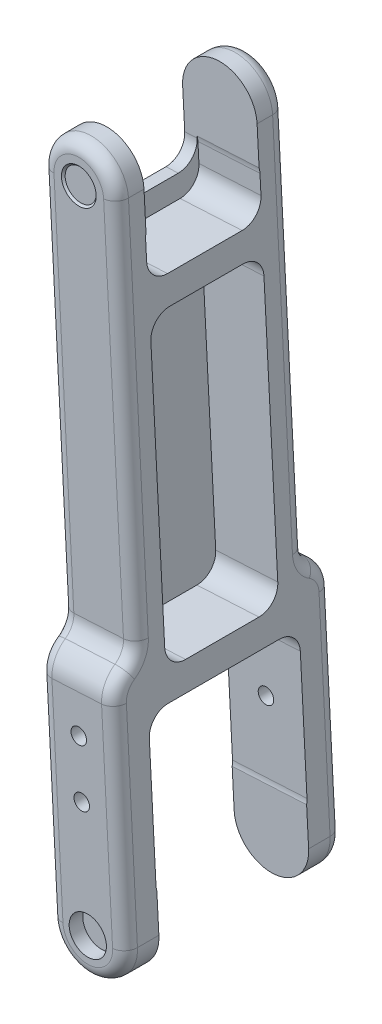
ISO-10303-21;
HEADER;
FILE_DESCRIPTION(('STEP AP214'),'2;1');
FILE_NAME('part.step','',(''),(''),'','','');
FILE_SCHEMA(('AUTOMOTIVE_DESIGN { 1 0 10303 214 1 1 1 1 }'));
ENDSEC;
DATA;
#1=APPLICATION_CONTEXT('core data for automotive mechanical design processes');
#2=APPLICATION_PROTOCOL_DEFINITION('international standard','automotive_design',2000,#1);
#3=PRODUCT_CONTEXT('',#1,'mechanical');
#4=PRODUCT('Part','Part','',(#3));
#5=PRODUCT_RELATED_PRODUCT_CATEGORY('part','',(#4));
#6=PRODUCT_DEFINITION_FORMATION('','',#4);
#7=PRODUCT_DEFINITION_CONTEXT('part definition',#1,'design');
#8=PRODUCT_DEFINITION('design','',#6,#7);
#9=PRODUCT_DEFINITION_SHAPE('','',#8);
#10=(LENGTH_UNIT() NAMED_UNIT(*) SI_UNIT(.MILLI.,.METRE.));
#11=(NAMED_UNIT(*) PLANE_ANGLE_UNIT() SI_UNIT($,.RADIAN.));
#12=(NAMED_UNIT(*) SI_UNIT($,.STERADIAN.) SOLID_ANGLE_UNIT());
#13=UNCERTAINTY_MEASURE_WITH_UNIT(LENGTH_MEASURE(1.E-05),#10,'distance_accuracy_value','');
#14=(GEOMETRIC_REPRESENTATION_CONTEXT(3) GLOBAL_UNCERTAINTY_ASSIGNED_CONTEXT((#13)) GLOBAL_UNIT_ASSIGNED_CONTEXT((#10,
#11,#12)) REPRESENTATION_CONTEXT('',''));
#15=CARTESIAN_POINT('',(0.,0.,0.));
#16=DIRECTION('',(0.,0.,1.));
#17=DIRECTION('',(1.,0.,0.));
#18=AXIS2_PLACEMENT_3D('',#15,#16,#17);
#19=CARTESIAN_POINT('',(15.1964310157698,61.5535371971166,-15.3));
#20=DIRECTION('',(0.,0.,1.));
#21=DIRECTION('',(0.,-1.,0.));
#22=AXIS2_PLACEMENT_3D('',#19,#20,#21);
#23=PLANE('',#22);
#24=CARTESIAN_POINT('',(12.699999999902,61.42,-15.3));
#25=DIRECTION('',(0.,0.,-1.));
#26=DIRECTION('',(0.,1.,0.));
#27=AXIS2_PLACEMENT_3D('',#24,#25,#26);
#28=CIRCLE('',#27,3.);
#29=CARTESIAN_POINT('',(12.699999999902,64.42,-15.3));
#30=VERTEX_POINT('',#29);
#31=EDGE_CURVE('E824',#30,#30,#28,.T.);
#32=ORIENTED_EDGE('',*,*,#31,.T.);
#33=EDGE_LOOP('',(#32));
#34=FACE_BOUND('',#33,.T.);
#35=ADVANCED_FACE('F17',(#34),#23,.F.);
#36=CARTESIAN_POINT('',(7.35851211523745,161.277240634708,-13.2999999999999));
#37=DIRECTION('',(0.,0.,1.));
#38=DIRECTION('',(0.,-1.,0.));
#39=AXIS2_PLACEMENT_3D('',#36,#37,#38);
#40=PLANE('',#39);
#41=CARTESIAN_POINT('',(7.35851211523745,161.277240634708,-13.2999999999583));
#42=DIRECTION('',(0.,0.,-1.));
#43=DIRECTION('',(-1.,0.,0.));
#44=AXIS2_PLACEMENT_3D('',#41,#42,#43);
#45=CIRCLE('',#44,2.50000000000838);
#46=CARTESIAN_POINT('',(4.85851211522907,161.277240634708,-13.2999999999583));
#47=VERTEX_POINT('',#46);
#48=EDGE_CURVE('E821',#47,#47,#45,.T.);
#49=ORIENTED_EDGE('',*,*,#48,.T.);
#50=EDGE_LOOP('',(#49));
#51=FACE_BOUND('',#50,.T.);
#52=ADVANCED_FACE('F1442',(#51),#40,.F.);
#53=CARTESIAN_POINT('',(7.35851211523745,161.277240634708,13.3));
#54=DIRECTION('',(0.,0.,1.));
#55=DIRECTION('',(0.,-1.,0.));
#56=AXIS2_PLACEMENT_3D('',#53,#54,#55);
#57=PLANE('',#56);
#58=CARTESIAN_POINT('',(7.35851211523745,161.277240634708,13.3000000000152));
#59=DIRECTION('',(0.,0.,1.));
#60=DIRECTION('',(0.,-1.,0.));
#61=AXIS2_PLACEMENT_3D('',#58,#59,#60);
#62=CIRCLE('',#61,2.50000000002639);
#63=CARTESIAN_POINT('',(7.35851211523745,158.777240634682,13.3000000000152));
#64=VERTEX_POINT('',#63);
#65=EDGE_CURVE('E818',#64,#64,#62,.T.);
#66=ORIENTED_EDGE('',*,*,#65,.T.);
#67=EDGE_LOOP('',(#66));
#68=FACE_BOUND('',#67,.T.);
#69=ADVANCED_FACE('F1434',(#68),#57,.T.);
#70=CARTESIAN_POINT('',(15.1964310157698,61.5535371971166,15.3));
#71=DIRECTION('',(0.,0.,-1.));
#72=DIRECTION('',(0.,1.,0.));
#73=AXIS2_PLACEMENT_3D('',#70,#71,#72);
#74=PLANE('',#73);
#75=CARTESIAN_POINT('',(12.699999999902,61.42,15.3));
#76=DIRECTION('',(0.,0.,1.));
#77=DIRECTION('',(0.,-1.,0.));
#78=AXIS2_PLACEMENT_3D('',#75,#76,#77);
#79=CIRCLE('',#78,3.);
#80=CARTESIAN_POINT('',(12.699999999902,58.42,15.3));
#81=VERTEX_POINT('',#80);
#82=EDGE_CURVE('E371',#81,#81,#79,.T.);
#83=ORIENTED_EDGE('',*,*,#82,.T.);
#84=EDGE_LOOP('',(#83));
#85=FACE_BOUND('',#84,.T.);
#86=ADVANCED_FACE('F1432',(#85),#74,.F.);
#87=CARTESIAN_POINT('',(8.70571037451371,61.2063404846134,0.));
#88=DIRECTION('',(0.99857240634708,0.0534148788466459,0.));
#89=DIRECTION('',(-0.0534148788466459,0.99857240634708,0.));
#90=AXIS2_PLACEMENT_3D('',#87,#88,#89);
#91=PLANE('',#90);
#92=DIRECTION('',(0.,0.,1.));
#93=VECTOR('',#92,1.);
#94=CARTESIAN_POINT('',(6.86289705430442,95.6570885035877,9.1000000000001));
#95=LINE('',#94,#93);
#96=CARTESIAN_POINT('',(6.86289705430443,95.6570885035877,5.9000000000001));
#97=VERTEX_POINT('',#96);
#98=CARTESIAN_POINT('',(6.86289705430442,95.6570885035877,-5.89999999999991));
#99=VERTEX_POINT('',#98);
#100=EDGE_CURVE('E376',#97,#99,#95,.F.);
#101=ORIENTED_EDGE('',*,*,#100,.T.);
#102=CARTESIAN_POINT('',(6.69196944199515,98.8525202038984,-5.8999999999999));
#103=DIRECTION('',(-0.99857240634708,-0.053414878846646,0.));
#104=DIRECTION('',(0.053414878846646,-0.99857240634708,0.));
#105=AXIS2_PLACEMENT_3D('',#102,#103,#104);
#106=CIRCLE('',#105,3.2);
#107=CARTESIAN_POINT('',(6.69196944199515,98.8525202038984,-9.0999999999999));
#108=VERTEX_POINT('',#107);
#109=EDGE_CURVE('E361',#99,#108,#106,.F.);
#110=ORIENTED_EDGE('',*,*,#109,.T.);
#111=DIRECTION('',(-0.0534148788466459,0.99857240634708,0.));
#112=VECTOR('',#111,1.);
#113=CARTESIAN_POINT('',(6.69196944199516,98.8525202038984,-9.0999999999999));
#114=LINE('',#113,#112);
#115=CARTESIAN_POINT('',(4.46991048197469,140.393132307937,-9.0999999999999));
#116=VERTEX_POINT('',#115);
#117=EDGE_CURVE('E404',#108,#116,#114,.T.);
#118=ORIENTED_EDGE('',*,*,#117,.T.);
#119=CARTESIAN_POINT('',(4.46991048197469,140.393132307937,-5.89999999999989));
#120=DIRECTION('',(-0.99857240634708,-0.0534148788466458,0.));
#121=DIRECTION('',(0.0534148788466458,-0.99857240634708,0.));
#122=AXIS2_PLACEMENT_3D('',#119,#120,#121);
#123=CIRCLE('',#122,3.20000000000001);
#124=CARTESIAN_POINT('',(4.29898286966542,143.588564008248,-5.89999999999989));
#125=VERTEX_POINT('',#124);
#126=EDGE_CURVE('E653',#116,#125,#123,.F.);
#127=ORIENTED_EDGE('',*,*,#126,.T.);
#128=DIRECTION('',(0.,0.,1.));
#129=VECTOR('',#128,1.);
#130=CARTESIAN_POINT('',(4.29898286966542,143.588564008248,9.10000000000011));
#131=LINE('',#130,#129);
#132=CARTESIAN_POINT('',(4.29898286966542,143.588564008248,5.90000000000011));
#133=VERTEX_POINT('',#132);
#134=EDGE_CURVE('E400',#125,#133,#131,.T.);
#135=ORIENTED_EDGE('',*,*,#134,.T.);
#136=CARTESIAN_POINT('',(4.46991048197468,140.393132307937,5.90000000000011));
#137=DIRECTION('',(-0.99857240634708,-0.0534148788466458,0.));
#138=DIRECTION('',(0.0534148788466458,-0.99857240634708,0.));
#139=AXIS2_PLACEMENT_3D('',#136,#137,#138);
#140=CIRCLE('',#139,3.20000000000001);
#141=CARTESIAN_POINT('',(4.46991048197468,140.393132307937,9.10000000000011));
#142=VERTEX_POINT('',#141);
#143=EDGE_CURVE('E648',#133,#142,#140,.F.);
#144=ORIENTED_EDGE('',*,*,#143,.T.);
#145=DIRECTION('',(0.0534148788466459,-0.99857240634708,0.));
#146=VECTOR('',#145,1.);
#147=CARTESIAN_POINT('',(4.46991048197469,140.393132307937,9.10000000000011));
#148=LINE('',#147,#146);
#149=CARTESIAN_POINT('',(6.69196944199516,98.8525202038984,9.1000000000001));
#150=VERTEX_POINT('',#149);
#151=EDGE_CURVE('E396',#142,#150,#148,.T.);
#152=ORIENTED_EDGE('',*,*,#151,.T.);
#153=CARTESIAN_POINT('',(6.69196944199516,98.8525202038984,5.9000000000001));
#154=DIRECTION('',(-0.99857240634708,-0.053414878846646,0.));
#155=DIRECTION('',(0.053414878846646,-0.99857240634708,0.));
#156=AXIS2_PLACEMENT_3D('',#153,#154,#155);
#157=CIRCLE('',#156,3.2);
#158=EDGE_CURVE('E381',#150,#97,#157,.F.);
#159=ORIENTED_EDGE('',*,*,#158,.T.);
#160=EDGE_LOOP('',(#101,#110,#118,#127,#135,#144,#152,#159));
#161=FACE_BOUND('',#160,.T.);
#162=ADVANCED_FACE('F383',(#161),#91,.T.);
#163=CARTESIAN_POINT('',(12.699999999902,61.42,-17.5));
#164=DIRECTION('',(0.,0.,-1.));
#165=DIRECTION('',(0.,1.,0.));
#166=AXIS2_PLACEMENT_3D('',#163,#164,#165);
#167=CYLINDRICAL_SURFACE('',#166,3.);
#168=ORIENTED_EDGE('',*,*,#31,.F.);
#169=EDGE_LOOP('',(#168));
#170=FACE_BOUND('',#169,.T.);
#171=CARTESIAN_POINT('',(12.699999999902,61.42,-17.5));
#172=DIRECTION('',(0.,0.,-1.));
#173=DIRECTION('',(0.,1.,0.));
#174=AXIS2_PLACEMENT_3D('',#171,#172,#173);
#175=CIRCLE('',#174,3.);
#176=CARTESIAN_POINT('',(12.699999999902,64.42,-17.5));
#177=VERTEX_POINT('',#176);
#178=EDGE_CURVE('E794',#177,#177,#175,.T.);
#179=ORIENTED_EDGE('',*,*,#178,.T.);
#180=EDGE_LOOP('',(#179));
#181=FACE_BOUND('',#180,.T.);
#182=ADVANCED_FACE('F1440',(#170,#181),#167,.F.);
#183=CARTESIAN_POINT('',(7.35851211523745,161.277240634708,-13.6000000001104));
#184=DIRECTION('',(0.,0.,-1.));
#185=DIRECTION('',(-1.,0.,0.));
#186=AXIS2_PLACEMENT_3D('',#183,#184,#185);
#187=CONICAL_SURFACE('',#186,2.80000000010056,0.785398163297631);
#188=CARTESIAN_POINT('',(7.35851211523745,161.277240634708,-13.6000000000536));
#189=DIRECTION('',(0.,0.,-1.));
#190=DIRECTION('',(-1.,0.,0.));
#191=AXIS2_PLACEMENT_3D('',#188,#189,#190);
#192=CIRCLE('',#191,2.80000000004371);
#193=CARTESIAN_POINT('',(4.55851211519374,161.277240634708,-13.6000000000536));
#194=VERTEX_POINT('',#193);
#195=EDGE_CURVE('E771',#194,#194,#192,.T.);
#196=ORIENTED_EDGE('',*,*,#195,.T.);
#197=EDGE_LOOP('',(#196));
#198=FACE_BOUND('',#197,.T.);
#199=ORIENTED_EDGE('',*,*,#48,.F.);
#200=EDGE_LOOP('',(#199));
#201=FACE_BOUND('',#200,.T.);
#202=ADVANCED_FACE('F1454',(#198,#201),#187,.F.);
#203=CARTESIAN_POINT('',(7.35851211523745,161.277240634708,13.6000000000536));
#204=DIRECTION('',(0.,0.,1.));
#205=DIRECTION('',(0.,-1.,0.));
#206=AXIS2_PLACEMENT_3D('',#203,#204,#205);
#207=CONICAL_SURFACE('',#206,2.80000000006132,0.785398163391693);
#208=ORIENTED_EDGE('',*,*,#65,.F.);
#209=EDGE_LOOP('',(#208));
#210=FACE_BOUND('',#209,.T.);
#211=CARTESIAN_POINT('',(7.35851211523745,161.277240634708,13.5999999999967));
#212=DIRECTION('',(0.,0.,1.));
#213=DIRECTION('',(0.,-1.,0.));
#214=AXIS2_PLACEMENT_3D('',#211,#212,#213);
#215=CIRCLE('',#214,2.80000000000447);
#216=CARTESIAN_POINT('',(7.35851211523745,158.477240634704,13.5999999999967));
#217=VERTEX_POINT('',#216);
#218=EDGE_CURVE('E714',#217,#217,#215,.T.);
#219=ORIENTED_EDGE('',*,*,#218,.T.);
#220=EDGE_LOOP('',(#219));
#221=FACE_BOUND('',#220,.T.);
#222=ADVANCED_FACE('F1428',(#210,#221),#207,.F.);
#223=CARTESIAN_POINT('',(12.699999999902,61.42,17.5));
#224=DIRECTION('',(0.,0.,1.));
#225=DIRECTION('',(0.,-1.,0.));
#226=AXIS2_PLACEMENT_3D('',#223,#224,#225);
#227=CYLINDRICAL_SURFACE('',#226,3.);
#228=CARTESIAN_POINT('',(12.699999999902,61.42,17.5));
#229=DIRECTION('',(0.,0.,1.));
#230=DIRECTION('',(0.,-1.,0.));
#231=AXIS2_PLACEMENT_3D('',#228,#229,#230);
#232=CIRCLE('',#231,3.);
#233=CARTESIAN_POINT('',(12.699999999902,58.42,17.5));
#234=VERTEX_POINT('',#233);
#235=EDGE_CURVE('E660',#234,#234,#232,.F.);
#236=ORIENTED_EDGE('',*,*,#235,.F.);
#237=EDGE_LOOP('',(#236));
#238=FACE_BOUND('',#237,.T.);
#239=ORIENTED_EDGE('',*,*,#82,.F.);
#240=EDGE_LOOP('',(#239));
#241=FACE_BOUND('',#240,.T.);
#242=ADVANCED_FACE('F1425',(#238,#241),#227,.F.);
#243=CARTESIAN_POINT('',(6.69196944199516,98.8525202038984,-5.8999999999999));
#244=DIRECTION('',(-0.99857240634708,-0.053414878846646,0.));
#245=DIRECTION('',(0.053414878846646,-0.99857240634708,0.));
#246=AXIS2_PLACEMENT_3D('',#243,#244,#245);
#247=CYLINDRICAL_SURFACE('',#246,3.2);
#248=DIRECTION('',(0.99857240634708,0.0534148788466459,0.));
#249=VECTOR('',#248,1.);
#250=CARTESIAN_POINT('',(6.86289705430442,95.6570885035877,-5.89999999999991));
#251=LINE('',#250,#249);
#252=CARTESIAN_POINT('',(16.8486211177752,96.1912372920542,-5.8999999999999));
#253=VERTEX_POINT('',#252);
#254=EDGE_CURVE('E365',#99,#253,#251,.T.);
#255=ORIENTED_EDGE('',*,*,#254,.T.);
#256=CARTESIAN_POINT('',(16.677693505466,99.3866689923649,-5.8999999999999));
#257=DIRECTION('',(-0.99857240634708,-0.053414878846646,0.));
#258=DIRECTION('',(0.053414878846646,-0.99857240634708,0.));
#259=AXIS2_PLACEMENT_3D('',#256,#257,#258);
#260=CIRCLE('',#259,3.2);
#261=CARTESIAN_POINT('',(16.677693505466,99.3866689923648,-9.09999999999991));
#262=VERTEX_POINT('',#261);
#263=EDGE_CURVE('E894',#253,#262,#260,.F.);
#264=ORIENTED_EDGE('',*,*,#263,.T.);
#265=DIRECTION('',(-0.99857240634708,-0.0534148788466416,0.));
#266=VECTOR('',#265,1.);
#267=CARTESIAN_POINT('',(16.6776935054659,99.3866689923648,-9.0999999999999));
#268=LINE('',#267,#266);
#269=EDGE_CURVE('E367',#262,#108,#268,.T.);
#270=ORIENTED_EDGE('',*,*,#269,.T.);
#271=ORIENTED_EDGE('',*,*,#109,.F.);
#272=EDGE_LOOP('',(#255,#264,#270,#271));
#273=FACE_BOUND('',#272,.T.);
#274=ADVANCED_FACE('F363',(#273),#247,.F.);
#275=CARTESIAN_POINT('',(4.29898286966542,143.588564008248,-9.09999999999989));
#276=DIRECTION('',(0.,0.,-1.));
#277=DIRECTION('',(0.,1.,0.));
#278=AXIS2_PLACEMENT_3D('',#275,#276,#277);
#279=PLANE('',#278);
#280=DIRECTION('',(-0.99857240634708,-0.0534148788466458,0.));
#281=VECTOR('',#280,1.);
#282=CARTESIAN_POINT('',(4.46991048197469,140.393132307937,-9.0999999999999));
#283=LINE('',#282,#281);
#284=CARTESIAN_POINT('',(14.4556345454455,140.927281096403,-9.09999999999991));
#285=VERTEX_POINT('',#284);
#286=EDGE_CURVE('E406',#285,#116,#283,.T.);
#287=ORIENTED_EDGE('',*,*,#286,.T.);
#288=ORIENTED_EDGE('',*,*,#117,.F.);
#289=ORIENTED_EDGE('',*,*,#269,.F.);
#290=DIRECTION('',(0.0534148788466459,-0.99857240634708,0.));
#291=VECTOR('',#290,1.);
#292=CARTESIAN_POINT('',(13.3499465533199,161.597729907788,-9.09999999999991));
#293=LINE('',#292,#291);
#294=EDGE_CURVE('E891',#262,#285,#293,.F.);
#295=ORIENTED_EDGE('',*,*,#294,.T.);
#296=EDGE_LOOP('',(#287,#288,#289,#295));
#297=FACE_BOUND('',#296,.T.);
#298=ADVANCED_FACE('F1469',(#297),#279,.F.);
#299=CARTESIAN_POINT('',(4.46991048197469,140.393132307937,-5.89999999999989));
#300=DIRECTION('',(-0.99857240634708,-0.0534148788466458,0.));
#301=DIRECTION('',(0.0534148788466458,-0.99857240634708,0.));
#302=AXIS2_PLACEMENT_3D('',#299,#300,#301);
#303=CYLINDRICAL_SURFACE('',#302,3.20000000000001);
#304=ORIENTED_EDGE('',*,*,#286,.F.);
#305=CARTESIAN_POINT('',(14.4556345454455,140.927281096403,-5.89999999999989));
#306=DIRECTION('',(-0.99857240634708,-0.0534148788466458,0.));
#307=DIRECTION('',(0.0534148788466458,-0.99857240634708,0.));
#308=AXIS2_PLACEMENT_3D('',#305,#306,#307);
#309=CIRCLE('',#308,3.20000000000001);
#310=CARTESIAN_POINT('',(14.2847069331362,144.122712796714,-5.89999999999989));
#311=VERTEX_POINT('',#310);
#312=EDGE_CURVE('E890',#285,#311,#309,.F.);
#313=ORIENTED_EDGE('',*,*,#312,.T.);
#314=DIRECTION('',(-0.99857240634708,-0.0534148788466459,0.));
#315=VECTOR('',#314,1.);
#316=CARTESIAN_POINT('',(4.29898286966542,143.588564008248,-5.8999999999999));
#317=LINE('',#316,#315);
#318=EDGE_CURVE('E403',#311,#125,#317,.T.);
#319=ORIENTED_EDGE('',*,*,#318,.T.);
#320=ORIENTED_EDGE('',*,*,#126,.F.);
#321=EDGE_LOOP('',(#304,#313,#319,#320));
#322=FACE_BOUND('',#321,.T.);
#323=ADVANCED_FACE('F1472',(#322),#303,.F.);
#324=CARTESIAN_POINT('',(4.29898286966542,143.588564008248,9.10000000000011));
#325=DIRECTION('',(-0.0534148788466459,0.99857240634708,0.));
#326=DIRECTION('',(-0.99857240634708,-0.0534148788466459,0.));
#327=AXIS2_PLACEMENT_3D('',#324,#325,#326);
#328=PLANE('',#327);
#329=ORIENTED_EDGE('',*,*,#318,.F.);
#330=DIRECTION('',(0.,0.,1.));
#331=VECTOR('',#330,1.);
#332=CARTESIAN_POINT('',(14.2847069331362,144.122712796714,17.5));
#333=LINE('',#332,#331);
#334=CARTESIAN_POINT('',(14.2847069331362,144.122712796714,5.90000000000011));
#335=VERTEX_POINT('',#334);
#336=EDGE_CURVE('E887',#311,#335,#333,.T.);
#337=ORIENTED_EDGE('',*,*,#336,.T.);
#338=DIRECTION('',(-0.99857240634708,-0.0534148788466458,0.));
#339=VECTOR('',#338,1.);
#340=CARTESIAN_POINT('',(4.29898286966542,143.588564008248,5.90000000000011));
#341=LINE('',#340,#339);
#342=EDGE_CURVE('E402',#335,#133,#341,.T.);
#343=ORIENTED_EDGE('',*,*,#342,.T.);
#344=ORIENTED_EDGE('',*,*,#134,.F.);
#345=EDGE_LOOP('',(#329,#337,#343,#344));
#346=FACE_BOUND('',#345,.T.);
#347=ADVANCED_FACE('F1476',(#346),#328,.F.);
#348=CARTESIAN_POINT('',(4.46991048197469,140.393132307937,5.90000000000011));
#349=DIRECTION('',(-0.99857240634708,-0.0534148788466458,0.));
#350=DIRECTION('',(0.0534148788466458,-0.99857240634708,0.));
#351=AXIS2_PLACEMENT_3D('',#348,#349,#350);
#352=CYLINDRICAL_SURFACE('',#351,3.20000000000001);
#353=ORIENTED_EDGE('',*,*,#342,.F.);
#354=CARTESIAN_POINT('',(14.4556345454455,140.927281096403,5.90000000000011));
#355=DIRECTION('',(-0.99857240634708,-0.0534148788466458,0.));
#356=DIRECTION('',(0.0534148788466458,-0.99857240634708,0.));
#357=AXIS2_PLACEMENT_3D('',#354,#355,#356);
#358=CIRCLE('',#357,3.20000000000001);
#359=CARTESIAN_POINT('',(14.4556345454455,140.927281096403,9.10000000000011));
#360=VERTEX_POINT('',#359);
#361=EDGE_CURVE('E886',#335,#360,#358,.F.);
#362=ORIENTED_EDGE('',*,*,#361,.T.);
#363=DIRECTION('',(-0.99857240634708,-0.0534148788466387,0.));
#364=VECTOR('',#363,1.);
#365=CARTESIAN_POINT('',(14.4556345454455,140.927281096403,9.10000000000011));
#366=LINE('',#365,#364);
#367=EDGE_CURVE('E399',#360,#142,#366,.T.);
#368=ORIENTED_EDGE('',*,*,#367,.T.);
#369=ORIENTED_EDGE('',*,*,#143,.F.);
#370=EDGE_LOOP('',(#353,#362,#368,#369));
#371=FACE_BOUND('',#370,.T.);
#372=ADVANCED_FACE('F1480',(#371),#352,.F.);
#373=CARTESIAN_POINT('',(4.29898286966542,143.588564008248,9.10000000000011));
#374=DIRECTION('',(0.,0.,1.));
#375=DIRECTION('',(0.,-1.,0.));
#376=AXIS2_PLACEMENT_3D('',#373,#374,#375);
#377=PLANE('',#376);
#378=ORIENTED_EDGE('',*,*,#367,.F.);
#379=DIRECTION('',(0.0534148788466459,-0.99857240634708,0.));
#380=VECTOR('',#379,1.);
#381=CARTESIAN_POINT('',(13.3499465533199,161.597729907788,9.10000000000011));
#382=LINE('',#381,#380);
#383=CARTESIAN_POINT('',(16.677693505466,99.3866689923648,9.1000000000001));
#384=VERTEX_POINT('',#383);
#385=EDGE_CURVE('E883',#360,#384,#382,.T.);
#386=ORIENTED_EDGE('',*,*,#385,.T.);
#387=DIRECTION('',(-0.99857240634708,-0.053414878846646,0.));
#388=VECTOR('',#387,1.);
#389=CARTESIAN_POINT('',(6.69196944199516,98.8525202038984,9.1000000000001));
#390=LINE('',#389,#388);
#391=EDGE_CURVE('E398',#384,#150,#390,.T.);
#392=ORIENTED_EDGE('',*,*,#391,.T.);
#393=ORIENTED_EDGE('',*,*,#151,.F.);
#394=EDGE_LOOP('',(#378,#386,#392,#393));
#395=FACE_BOUND('',#394,.T.);
#396=ADVANCED_FACE('F1484',(#395),#377,.F.);
#397=CARTESIAN_POINT('',(6.69196944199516,98.8525202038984,5.9000000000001));
#398=DIRECTION('',(-0.99857240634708,-0.053414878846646,0.));
#399=DIRECTION('',(0.053414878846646,-0.99857240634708,0.));
#400=AXIS2_PLACEMENT_3D('',#397,#398,#399);
#401=CYLINDRICAL_SURFACE('',#400,3.2);
#402=ORIENTED_EDGE('',*,*,#391,.F.);
#403=CARTESIAN_POINT('',(16.677693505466,99.3866689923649,5.9000000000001));
#404=DIRECTION('',(-0.99857240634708,-0.053414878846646,0.));
#405=DIRECTION('',(0.053414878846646,-0.99857240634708,0.));
#406=AXIS2_PLACEMENT_3D('',#403,#404,#405);
#407=CIRCLE('',#406,3.2);
#408=CARTESIAN_POINT('',(16.8486211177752,96.1912372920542,5.9000000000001));
#409=VERTEX_POINT('',#408);
#410=EDGE_CURVE('E882',#384,#409,#407,.F.);
#411=ORIENTED_EDGE('',*,*,#410,.T.);
#412=DIRECTION('',(0.99857240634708,0.0534148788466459,0.));
#413=VECTOR('',#412,1.);
#414=CARTESIAN_POINT('',(6.86289705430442,95.6570885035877,5.9000000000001));
#415=LINE('',#414,#413);
#416=EDGE_CURVE('E380',#409,#97,#415,.F.);
#417=ORIENTED_EDGE('',*,*,#416,.T.);
#418=ORIENTED_EDGE('',*,*,#158,.F.);
#419=EDGE_LOOP('',(#402,#411,#417,#418));
#420=FACE_BOUND('',#419,.T.);
#421=ADVANCED_FACE('F1487',(#420),#401,.F.);
#422=CARTESIAN_POINT('',(6.86289705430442,95.6570885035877,9.1000000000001));
#423=DIRECTION('',(0.0534148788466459,-0.99857240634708,0.));
#424=DIRECTION('',(0.99857240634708,0.0534148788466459,0.));
#425=AXIS2_PLACEMENT_3D('',#422,#423,#424);
#426=PLANE('',#425);
#427=ORIENTED_EDGE('',*,*,#416,.F.);
#428=DIRECTION('',(0.,0.,1.));
#429=VECTOR('',#428,1.);
#430=CARTESIAN_POINT('',(16.8486211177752,96.1912372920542,17.5));
#431=LINE('',#430,#429);
#432=EDGE_CURVE('E379',#409,#253,#431,.F.);
#433=ORIENTED_EDGE('',*,*,#432,.T.);
#434=ORIENTED_EDGE('',*,*,#254,.F.);
#435=ORIENTED_EDGE('',*,*,#100,.F.);
#436=EDGE_LOOP('',(#427,#433,#434,#435));
#437=FACE_BOUND('',#436,.T.);
#438=ADVANCED_FACE('F375',(#437),#426,.F.);
#439=CARTESIAN_POINT('',(14.5470114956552,101.776270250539,16.8));
#440=DIRECTION('',(-0.99857240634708,-0.0534148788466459,0.));
#441=DIRECTION('',(0.0534148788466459,-0.99857240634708,0.));
#442=AXIS2_PLACEMENT_3D('',#439,#440,#441);
#443=TOROIDAL_SURFACE('',#442,5.20000000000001,2.);
#444=CARTESIAN_POINT('',(14.5470114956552,101.776270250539,11.6));
#445=DIRECTION('',(0.0534148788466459,-0.99857240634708,0.));
#446=DIRECTION('',(0.99857240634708,0.0534148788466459,0.));
#447=AXIS2_PLACEMENT_3D('',#444,#445,#446);
#448=CIRCLE('',#447,2.);
#449=CARTESIAN_POINT('',(14.5470114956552,101.776270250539,13.6));
#450=VERTEX_POINT('',#449);
#451=CARTESIAN_POINT('',(16.5441563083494,101.883100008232,11.6));
#452=VERTEX_POINT('',#451);
#453=EDGE_CURVE('E385',#450,#452,#448,.F.);
#454=ORIENTED_EDGE('',*,*,#453,.F.);
#455=CARTESIAN_POINT('',(14.5470114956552,101.776270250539,16.8));
#456=DIRECTION('',(-0.99857240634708,-0.0534148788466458,0.));
#457=DIRECTION('',(0.0534148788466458,-0.99857240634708,0.));
#458=AXIS2_PLACEMENT_3D('',#455,#456,#457);
#459=CIRCLE('',#458,3.2);
#460=CARTESIAN_POINT('',(14.6925526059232,99.0554302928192,15.1219512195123));
#461=VERTEX_POINT('',#460);
#462=EDGE_CURVE('E664',#450,#461,#459,.T.);
#463=ORIENTED_EDGE('',*,*,#462,.T.);
#464=CARTESIAN_POINT('',(14.7835157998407,97.3549053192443,14.0731707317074));
#465=DIRECTION('',(-0.0280102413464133,0.523641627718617,-0.851478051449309));
#466=DIRECTION('',(-0.0454815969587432,0.85026248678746,0.524390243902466));
#467=AXIS2_PLACEMENT_3D('',#464,#465,#466);
#468=CIRCLE('',#467,2.);
#469=CARTESIAN_POINT('',(16.7806606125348,97.4617350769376,14.0731707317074));
#470=VERTEX_POINT('',#469);
#471=EDGE_CURVE('E543',#470,#461,#468,.F.);
#472=ORIENTED_EDGE('',*,*,#471,.F.);
#473=CARTESIAN_POINT('',(16.5441563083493,101.883100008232,16.8));
#474=DIRECTION('',(0.99857240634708,0.0534148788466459,0.));
#475=DIRECTION('',(0.0454815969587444,-0.850262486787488,-0.52439024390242));
#476=AXIS2_PLACEMENT_3D('',#473,#474,#475);
#477=CIRCLE('',#476,5.19999999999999);
#478=EDGE_CURVE('E878',#470,#452,#477,.T.);
#479=ORIENTED_EDGE('',*,*,#478,.T.);
#480=EDGE_LOOP('',(#454,#463,#472,#479));
#481=FACE_BOUND('',#480,.T.);
#482=ADVANCED_FACE('F627',(#481),#443,.T.);
#483=CARTESIAN_POINT('',(11.3528017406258,161.490900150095,11.6));
#484=DIRECTION('',(0.0534148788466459,-0.99857240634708,0.));
#485=DIRECTION('',(0.99857240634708,0.0534148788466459,0.));
#486=AXIS2_PLACEMENT_3D('',#483,#484,#485);
#487=CYLINDRICAL_SURFACE('',#486,2.);
#488=CARTESIAN_POINT('',(11.3528017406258,161.490900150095,11.6));
#489=DIRECTION('',(0.0534148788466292,-0.998572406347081,0.));
#490=DIRECTION('',(0.998572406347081,0.053414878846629,0.));
#491=AXIS2_PLACEMENT_3D('',#488,#489,#490);
#492=CIRCLE('',#491,2.);
#493=CARTESIAN_POINT('',(11.3528017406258,161.490900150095,13.6));
#494=VERTEX_POINT('',#493);
#495=CARTESIAN_POINT('',(13.3499465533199,161.597729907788,11.6));
#496=VERTEX_POINT('',#495);
#497=EDGE_CURVE('E712',#494,#496,#492,.F.);
#498=ORIENTED_EDGE('',*,*,#497,.F.);
#499=DIRECTION('',(0.0534148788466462,-0.99857240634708,0.));
#500=VECTOR('',#499,1.);
#501=CARTESIAN_POINT('',(11.3528017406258,161.490900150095,13.6));
#502=LINE('',#501,#500);
#503=EDGE_CURVE('E668',#494,#450,#502,.T.);
#504=ORIENTED_EDGE('',*,*,#503,.T.);
#505=ORIENTED_EDGE('',*,*,#453,.T.);
#506=DIRECTION('',(0.0534148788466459,-0.99857240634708,0.));
#507=VECTOR('',#506,1.);
#508=CARTESIAN_POINT('',(13.3499465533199,161.597729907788,11.6));
#509=LINE('',#508,#507);
#510=EDGE_CURVE('E875',#452,#496,#509,.F.);
#511=ORIENTED_EDGE('',*,*,#510,.T.);
#512=EDGE_LOOP('',(#498,#504,#505,#511));
#513=FACE_BOUND('',#512,.T.);
#514=ADVANCED_FACE('F632',(#513),#487,.T.);
#515=CARTESIAN_POINT('',(1.68756695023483,154.965316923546,9.20000000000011));
#516=DIRECTION('',(0.,0.,1.));
#517=DIRECTION('',(0.,-1.,0.));
#518=AXIS2_PLACEMENT_3D('',#515,#516,#517);
#519=PLANE('',#518);
#520=DIRECTION('',(0.99857240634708,0.0534148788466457,0.));
#521=VECTOR('',#520,1.);
#522=CARTESIAN_POINT('',(1.72996369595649,154.17272464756,9.20000000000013));
#523=LINE('',#522,#521);
#524=CARTESIAN_POINT('',(3.72710850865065,154.279554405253,9.20000000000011));
#525=VERTEX_POINT('',#524);
#526=CARTESIAN_POINT('',(13.7128325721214,154.81370319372,9.20000000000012));
#527=VERTEX_POINT('',#526);
#528=EDGE_CURVE('E616',#525,#527,#523,.T.);
#529=ORIENTED_EDGE('',*,*,#528,.T.);
#530=DIRECTION('',(0.0534148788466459,-0.99857240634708,0.));
#531=VECTOR('',#530,1.);
#532=CARTESIAN_POINT('',(13.3499465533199,161.597729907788,9.20000000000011));
#533=LINE('',#532,#531);
#534=CARTESIAN_POINT('',(13.8734123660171,151.811720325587,9.20000000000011));
#535=VERTEX_POINT('',#534);
#536=EDGE_CURVE('E867',#527,#535,#533,.T.);
#537=ORIENTED_EDGE('',*,*,#536,.T.);
#538=DIRECTION('',(-0.99857240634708,-0.0534148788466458,0.));
#539=VECTOR('',#538,1.);
#540=CARTESIAN_POINT('',(1.89054348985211,151.170741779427,9.20000000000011));
#541=LINE('',#540,#539);
#542=CARTESIAN_POINT('',(3.88768830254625,151.27757153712,9.20000000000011));
#543=VERTEX_POINT('',#542);
#544=EDGE_CURVE('E387',#535,#543,#541,.T.);
#545=ORIENTED_EDGE('',*,*,#544,.T.);
#546=DIRECTION('',(0.0534148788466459,-0.99857240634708,0.));
#547=VECTOR('',#546,1.);
#548=CARTESIAN_POINT('',(8.70571037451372,61.2063404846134,9.2000000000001));
#549=LINE('',#548,#547);
#550=EDGE_CURVE('E725',#543,#525,#549,.F.);
#551=ORIENTED_EDGE('',*,*,#550,.T.);
#552=EDGE_LOOP('',(#529,#537,#545,#551));
#553=FACE_BOUND('',#552,.T.);
#554=ADVANCED_FACE('F1831',(#553),#519,.F.);
#555=CARTESIAN_POINT('',(1.89054348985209,151.170741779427,6.00000000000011));
#556=DIRECTION('',(-0.99857240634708,-0.0534148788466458,0.));
#557=DIRECTION('',(0.0534148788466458,-0.99857240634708,0.));
#558=AXIS2_PLACEMENT_3D('',#555,#556,#557);
#559=CYLINDRICAL_SURFACE('',#558,3.2);
#560=ORIENTED_EDGE('',*,*,#544,.F.);
#561=CARTESIAN_POINT('',(13.873412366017,151.811720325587,6.00000000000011));
#562=DIRECTION('',(-0.99857240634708,-0.0534148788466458,0.));
#563=DIRECTION('',(0.0534148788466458,-0.99857240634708,0.));
#564=AXIS2_PLACEMENT_3D('',#561,#562,#563);
#565=CIRCLE('',#564,3.2);
#566=CARTESIAN_POINT('',(14.0443399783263,148.616288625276,6.00000000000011));
#567=VERTEX_POINT('',#566);
#568=EDGE_CURVE('E863',#535,#567,#565,.F.);
#569=ORIENTED_EDGE('',*,*,#568,.T.);
#570=DIRECTION('',(0.99857240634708,0.0534148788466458,0.));
#571=VECTOR('',#570,1.);
#572=CARTESIAN_POINT('',(2.06147110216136,147.975310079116,6.00000000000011));
#573=LINE('',#572,#571);
#574=CARTESIAN_POINT('',(4.05861591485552,148.082139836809,6.00000000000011));
#575=VERTEX_POINT('',#574);
#576=EDGE_CURVE('E613',#567,#575,#573,.F.);
#577=ORIENTED_EDGE('',*,*,#576,.T.);
#578=CARTESIAN_POINT('',(3.88768830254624,151.27757153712,6.00000000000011));
#579=DIRECTION('',(-0.99857240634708,-0.0534148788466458,0.));
#580=DIRECTION('',(0.0534148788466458,-0.99857240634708,0.));
#581=AXIS2_PLACEMENT_3D('',#578,#579,#580);
#582=CIRCLE('',#581,3.2);
#583=EDGE_CURVE('E728',#575,#543,#582,.T.);
#584=ORIENTED_EDGE('',*,*,#583,.T.);
#585=EDGE_LOOP('',(#560,#569,#577,#584));
#586=FACE_BOUND('',#585,.T.);
#587=ADVANCED_FACE('F1824',(#586),#559,.F.);
#588=CARTESIAN_POINT('',(2.06147110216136,147.975310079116,9.10000000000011));
#589=DIRECTION('',(0.0534148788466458,-0.99857240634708,0.));
#590=DIRECTION('',(0.99857240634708,0.0534148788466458,0.));
#591=AXIS2_PLACEMENT_3D('',#588,#589,#590);
#592=PLANE('',#591);
#593=DIRECTION('',(-0.99857240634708,-0.0534148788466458,0.));
#594=VECTOR('',#593,1.);
#595=CARTESIAN_POINT('',(2.06147110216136,147.975310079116,-5.99999999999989));
#596=LINE('',#595,#594);
#597=CARTESIAN_POINT('',(14.0443399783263,148.616288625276,-5.99999999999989));
#598=VERTEX_POINT('',#597);
#599=CARTESIAN_POINT('',(4.05861591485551,148.08213983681,-5.99999999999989));
#600=VERTEX_POINT('',#599);
#601=EDGE_CURVE('E611',#598,#600,#596,.T.);
#602=ORIENTED_EDGE('',*,*,#601,.T.);
#603=DIRECTION('',(0.,0.,1.));
#604=VECTOR('',#603,1.);
#605=CARTESIAN_POINT('',(4.05861591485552,148.082139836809,0.));
#606=LINE('',#605,#604);
#607=EDGE_CURVE('E729',#600,#575,#606,.T.);
#608=ORIENTED_EDGE('',*,*,#607,.T.);
#609=ORIENTED_EDGE('',*,*,#576,.F.);
#610=DIRECTION('',(0.,0.,1.));
#611=VECTOR('',#610,1.);
#612=CARTESIAN_POINT('',(14.0443399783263,148.616288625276,17.5));
#613=LINE('',#612,#611);
#614=EDGE_CURVE('E858',#567,#598,#613,.F.);
#615=ORIENTED_EDGE('',*,*,#614,.T.);
#616=EDGE_LOOP('',(#602,#608,#609,#615));
#617=FACE_BOUND('',#616,.T.);
#618=ADVANCED_FACE('F855',(#617),#592,.F.);
#619=CARTESIAN_POINT('',(1.89054348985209,151.170741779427,-5.99999999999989));
#620=DIRECTION('',(-0.99857240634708,-0.0534148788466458,0.));
#621=DIRECTION('',(0.0534148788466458,-0.99857240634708,0.));
#622=AXIS2_PLACEMENT_3D('',#619,#620,#621);
#623=CYLINDRICAL_SURFACE('',#622,3.2);
#624=ORIENTED_EDGE('',*,*,#601,.F.);
#625=CARTESIAN_POINT('',(13.873412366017,151.811720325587,-5.99999999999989));
#626=DIRECTION('',(-0.99857240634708,-0.0534148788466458,0.));
#627=DIRECTION('',(0.0534148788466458,-0.99857240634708,0.));
#628=AXIS2_PLACEMENT_3D('',#625,#626,#627);
#629=CIRCLE('',#628,3.2);
#630=CARTESIAN_POINT('',(13.873412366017,151.811720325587,-9.1999999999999));
#631=VERTEX_POINT('',#630);
#632=EDGE_CURVE('E862',#598,#631,#629,.F.);
#633=ORIENTED_EDGE('',*,*,#632,.T.);
#634=DIRECTION('',(-0.99857240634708,-0.0534148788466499,0.));
#635=VECTOR('',#634,1.);
#636=CARTESIAN_POINT('',(13.873412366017,151.811720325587,-9.19999999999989));
#637=LINE('',#636,#635);
#638=CARTESIAN_POINT('',(3.88768830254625,151.27757153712,-9.19999999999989));
#639=VERTEX_POINT('',#638);
#640=EDGE_CURVE('E602',#631,#639,#637,.T.);
#641=ORIENTED_EDGE('',*,*,#640,.T.);
#642=CARTESIAN_POINT('',(3.88768830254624,151.27757153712,-5.99999999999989));
#643=DIRECTION('',(-0.99857240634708,-0.0534148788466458,0.));
#644=DIRECTION('',(0.0534148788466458,-0.99857240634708,0.));
#645=AXIS2_PLACEMENT_3D('',#642,#643,#644);
#646=CIRCLE('',#645,3.2);
#647=EDGE_CURVE('E607',#639,#600,#646,.T.);
#648=ORIENTED_EDGE('',*,*,#647,.T.);
#649=EDGE_LOOP('',(#624,#633,#641,#648));
#650=FACE_BOUND('',#649,.T.);
#651=ADVANCED_FACE('F845',(#650),#623,.F.);
#652=CARTESIAN_POINT('',(1.68756695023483,154.965316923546,-9.19999999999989));
#653=DIRECTION('',(0.,0.,-1.));
#654=DIRECTION('',(0.,1.,0.));
#655=AXIS2_PLACEMENT_3D('',#652,#653,#654);
#656=PLANE('',#655);
#657=DIRECTION('',(-0.99857240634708,-0.0534148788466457,0.));
#658=VECTOR('',#657,1.);
#659=CARTESIAN_POINT('',(1.72996369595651,154.17272464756,-9.1999999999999));
#660=LINE('',#659,#658);
#661=CARTESIAN_POINT('',(13.7128325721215,154.81370319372,-9.1999999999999));
#662=VERTEX_POINT('',#661);
#663=CARTESIAN_POINT('',(3.72710850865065,154.279554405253,-9.1999999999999));
#664=VERTEX_POINT('',#663);
#665=EDGE_CURVE('E605',#662,#664,#660,.T.);
#666=ORIENTED_EDGE('',*,*,#665,.T.);
#667=DIRECTION('',(0.0534148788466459,-0.99857240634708,0.));
#668=VECTOR('',#667,1.);
#669=CARTESIAN_POINT('',(8.70571037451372,61.2063404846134,-9.19999999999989));
#670=LINE('',#669,#668);
#671=EDGE_CURVE('E618',#664,#639,#670,.T.);
#672=ORIENTED_EDGE('',*,*,#671,.T.);
#673=ORIENTED_EDGE('',*,*,#640,.F.);
#674=DIRECTION('',(0.0534148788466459,-0.99857240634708,0.));
#675=VECTOR('',#674,1.);
#676=CARTESIAN_POINT('',(13.3499465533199,161.597729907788,-9.1999999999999));
#677=LINE('',#676,#675);
#678=EDGE_CURVE('E865',#631,#662,#677,.F.);
#679=ORIENTED_EDGE('',*,*,#678,.T.);
#680=EDGE_LOOP('',(#666,#672,#673,#679));
#681=FACE_BOUND('',#680,.T.);
#682=ADVANCED_FACE('F1805',(#681),#656,.F.);
#683=CARTESIAN_POINT('',(11.3528017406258,161.490900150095,-11.5999999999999));
#684=DIRECTION('',(-0.0534148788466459,0.99857240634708,0.));
#685=DIRECTION('',(-0.99857240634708,-0.0534148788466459,0.));
#686=AXIS2_PLACEMENT_3D('',#683,#684,#685);
#687=CYLINDRICAL_SURFACE('',#686,2.);
#688=CARTESIAN_POINT('',(11.3528017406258,161.490900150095,-11.5999999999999));
#689=DIRECTION('',(-0.0534148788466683,0.998572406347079,0.));
#690=DIRECTION('',(0.998572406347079,0.0534148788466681,0.));
#691=AXIS2_PLACEMENT_3D('',#688,#689,#690);
#692=CIRCLE('',#691,2.);
#693=CARTESIAN_POINT('',(13.3499465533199,161.597729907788,-11.5999999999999));
#694=VERTEX_POINT('',#693);
#695=CARTESIAN_POINT('',(11.3528017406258,161.490900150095,-13.5999999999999));
#696=VERTEX_POINT('',#695);
#697=EDGE_CURVE('E747',#694,#696,#692,.T.);
#698=ORIENTED_EDGE('',*,*,#697,.F.);
#699=DIRECTION('',(0.0534148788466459,-0.99857240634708,0.));
#700=VECTOR('',#699,1.);
#701=CARTESIAN_POINT('',(13.3499465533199,161.597729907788,-11.5999999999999));
#702=LINE('',#701,#700);
#703=CARTESIAN_POINT('',(16.5441563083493,101.883100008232,-11.6));
#704=VERTEX_POINT('',#703);
#705=EDGE_CURVE('E1403',#694,#704,#702,.T.);
#706=ORIENTED_EDGE('',*,*,#705,.T.);
#707=CARTESIAN_POINT('',(14.5470114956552,101.776270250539,-11.6));
#708=DIRECTION('',(-0.0534148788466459,0.99857240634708,0.));
#709=DIRECTION('',(0.,0.,1.));
#710=AXIS2_PLACEMENT_3D('',#707,#708,#709);
#711=CIRCLE('',#710,2.);
#712=CARTESIAN_POINT('',(14.5470114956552,101.776270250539,-13.5999999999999));
#713=VERTEX_POINT('',#712);
#714=EDGE_CURVE('E584',#713,#704,#711,.F.);
#715=ORIENTED_EDGE('',*,*,#714,.F.);
#716=DIRECTION('',(-0.0534148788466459,0.99857240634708,0.));
#717=VECTOR('',#716,1.);
#718=CARTESIAN_POINT('',(14.5470114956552,101.776270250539,-13.5999999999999));
#719=LINE('',#718,#717);
#720=EDGE_CURVE('E1341',#713,#696,#719,.T.);
#721=ORIENTED_EDGE('',*,*,#720,.T.);
#722=EDGE_LOOP('',(#698,#706,#715,#721));
#723=FACE_BOUND('',#722,.T.);
#724=ADVANCED_FACE('F1710',(#723),#687,.T.);
#725=CARTESIAN_POINT('',(14.5470114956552,101.776270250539,-16.8));
#726=DIRECTION('',(-0.99857240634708,-0.0534148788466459,0.));
#727=DIRECTION('',(0.0534148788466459,-0.99857240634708,0.));
#728=AXIS2_PLACEMENT_3D('',#725,#726,#727);
#729=TOROIDAL_SURFACE('',#728,5.20000000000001,2.);
#730=ORIENTED_EDGE('',*,*,#714,.T.);
#731=CARTESIAN_POINT('',(16.5441563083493,101.883100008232,-16.8));
#732=DIRECTION('',(0.99857240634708,0.0534148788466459,0.));
#733=DIRECTION('',(0.,0.,1.));
#734=AXIS2_PLACEMENT_3D('',#731,#732,#733);
#735=CIRCLE('',#734,5.20000000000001);
#736=CARTESIAN_POINT('',(16.7806606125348,97.4617350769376,-14.0731707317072));
#737=VERTEX_POINT('',#736);
#738=EDGE_CURVE('E592',#704,#737,#735,.T.);
#739=ORIENTED_EDGE('',*,*,#738,.T.);
#740=CARTESIAN_POINT('',(14.7835157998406,97.3549053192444,-14.0731707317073));
#741=DIRECTION('',(0.0280102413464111,-0.523641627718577,-0.851478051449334));
#742=DIRECTION('',(-0.0454815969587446,0.850262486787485,-0.524390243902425));
#743=AXIS2_PLACEMENT_3D('',#740,#741,#742);
#744=CIRCLE('',#743,2.);
#745=CARTESIAN_POINT('',(14.6925526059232,99.0554302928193,-15.1219512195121));
#746=VERTEX_POINT('',#745);
#747=EDGE_CURVE('E559',#746,#737,#744,.T.);
#748=ORIENTED_EDGE('',*,*,#747,.F.);
#749=CARTESIAN_POINT('',(14.5470114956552,101.776270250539,-16.8));
#750=DIRECTION('',(-0.99857240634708,-0.0534148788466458,0.));
#751=DIRECTION('',(0.0534148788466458,-0.99857240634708,0.));
#752=AXIS2_PLACEMENT_3D('',#749,#750,#751);
#753=CIRCLE('',#752,3.2);
#754=EDGE_CURVE('E763',#746,#713,#753,.T.);
#755=ORIENTED_EDGE('',*,*,#754,.T.);
#756=EDGE_LOOP('',(#730,#739,#748,#755));
#757=FACE_BOUND('',#756,.T.);
#758=ADVANCED_FACE('F570',(#757),#729,.T.);
#759=CARTESIAN_POINT('',(14.9199605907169,94.8041178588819,-12.5));
#760=DIRECTION('',(-0.99857240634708,-0.0534148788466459,0.));
#761=DIRECTION('',(0.0534148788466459,-0.99857240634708,0.));
#762=AXIS2_PLACEMENT_3D('',#759,#760,#761);
#763=TOROIDAL_SURFACE('',#762,3.,2.);
#764=ORIENTED_EDGE('',*,*,#747,.T.);
#765=CARTESIAN_POINT('',(16.917105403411,94.9109476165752,-12.5));
#766=DIRECTION('',(-0.99857240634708,-0.0534148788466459,0.));
#767=DIRECTION('',(-0.0454815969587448,0.850262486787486,-0.524390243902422));
#768=AXIS2_PLACEMENT_3D('',#765,#766,#767);
#769=CIRCLE('',#768,2.99999999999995);
#770=CARTESIAN_POINT('',(16.9171054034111,94.9109476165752,-15.5));
#771=VERTEX_POINT('',#770);
#772=EDGE_CURVE('E2116',#737,#771,#769,.T.);
#773=ORIENTED_EDGE('',*,*,#772,.T.);
#774=CARTESIAN_POINT('',(14.9199605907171,94.8041178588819,-15.5));
#775=DIRECTION('',(-0.0534148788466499,0.99857240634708,0.));
#776=DIRECTION('',(-0.99857240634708,-0.0534148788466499,0.));
#777=AXIS2_PLACEMENT_3D('',#774,#775,#776);
#778=CIRCLE('',#777,2.);
#779=CARTESIAN_POINT('',(14.9199605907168,94.8041178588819,-17.5));
#780=VERTEX_POINT('',#779);
#781=EDGE_CURVE('E551',#780,#771,#778,.F.);
#782=ORIENTED_EDGE('',*,*,#781,.F.);
#783=CARTESIAN_POINT('',(14.9199605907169,94.8041178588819,-12.5));
#784=DIRECTION('',(-0.99857240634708,-0.0534148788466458,0.));
#785=DIRECTION('',(0.0534148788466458,-0.99857240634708,0.));
#786=AXIS2_PLACEMENT_3D('',#783,#784,#785);
#787=CIRCLE('',#786,5.);
#788=EDGE_CURVE('E775',#746,#780,#787,.T.);
#789=ORIENTED_EDGE('',*,*,#788,.F.);
#790=EDGE_LOOP('',(#764,#773,#782,#789));
#791=FACE_BOUND('',#790,.T.);
#792=ADVANCED_FACE('F566',(#791),#763,.T.);
#793=CARTESIAN_POINT('',(11.3528017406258,161.490900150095,-15.5));
#794=DIRECTION('',(-0.0534148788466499,0.99857240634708,0.));
#795=DIRECTION('',(-0.99857240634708,-0.0534148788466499,0.));
#796=AXIS2_PLACEMENT_3D('',#793,#794,#795);
#797=CYLINDRICAL_SURFACE('',#796,2.);
#798=ORIENTED_EDGE('',*,*,#781,.T.);
#799=DIRECTION('',(0.0534148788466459,-0.99857240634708,0.));
#800=VECTOR('',#799,1.);
#801=CARTESIAN_POINT('',(13.3499465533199,161.597729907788,-15.5));
#802=LINE('',#801,#800);
#803=CARTESIAN_POINT('',(18.6914344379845,61.7404892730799,-15.5));
#804=VERTEX_POINT('',#803);
#805=EDGE_CURVE('E1401',#771,#804,#802,.T.);
#806=ORIENTED_EDGE('',*,*,#805,.T.);
#807=CARTESIAN_POINT('',(16.6942896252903,61.6336595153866,-15.5));
#808=DIRECTION('',(-0.0534148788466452,0.99857240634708,0.));
#809=DIRECTION('',(0.99857240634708,0.0534148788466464,0.));
#810=AXIS2_PLACEMENT_3D('',#807,#808,#809);
#811=CIRCLE('',#810,2.);
#812=CARTESIAN_POINT('',(16.6942896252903,61.6336595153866,-17.5));
#813=VERTEX_POINT('',#812);
#814=EDGE_CURVE('E787',#813,#804,#811,.F.);
#815=ORIENTED_EDGE('',*,*,#814,.F.);
#816=DIRECTION('',(-0.0534148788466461,0.99857240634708,0.));
#817=VECTOR('',#816,1.);
#818=CARTESIAN_POINT('',(16.6942896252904,61.6336595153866,-17.5));
#819=LINE('',#818,#817);
#820=EDGE_CURVE('E779',#813,#780,#819,.T.);
#821=ORIENTED_EDGE('',*,*,#820,.T.);
#822=EDGE_LOOP('',(#798,#806,#815,#821));
#823=FACE_BOUND('',#822,.T.);
#824=ADVANCED_FACE('F526',(#823),#797,.T.);
#825=CARTESIAN_POINT('',(14.9199605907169,94.8041178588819,12.5));
#826=DIRECTION('',(-0.99857240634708,-0.0534148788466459,0.));
#827=DIRECTION('',(0.0534148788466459,-0.99857240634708,0.));
#828=AXIS2_PLACEMENT_3D('',#825,#826,#827);
#829=TOROIDAL_SURFACE('',#828,3.,2.);
#830=CARTESIAN_POINT('',(14.9199605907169,94.8041178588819,15.5));
#831=DIRECTION('',(0.0534148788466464,-0.99857240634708,0.));
#832=DIRECTION('',(0.99857240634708,0.0534148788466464,0.));
#833=AXIS2_PLACEMENT_3D('',#830,#831,#832);
#834=CIRCLE('',#833,2.);
#835=CARTESIAN_POINT('',(16.917105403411,94.9109476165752,15.5));
#836=VERTEX_POINT('',#835);
#837=CARTESIAN_POINT('',(14.9199605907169,94.8041178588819,17.5));
#838=VERTEX_POINT('',#837);
#839=EDGE_CURVE('E550',#836,#838,#834,.T.);
#840=ORIENTED_EDGE('',*,*,#839,.F.);
#841=CARTESIAN_POINT('',(16.9171054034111,94.9109476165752,12.5));
#842=DIRECTION('',(-0.99857240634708,-0.0534148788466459,0.));
#843=DIRECTION('',(0.,0.,1.));
#844=AXIS2_PLACEMENT_3D('',#841,#842,#843);
#845=CIRCLE('',#844,3.);
#846=EDGE_CURVE('E539',#836,#470,#845,.T.);
#847=ORIENTED_EDGE('',*,*,#846,.T.);
#848=ORIENTED_EDGE('',*,*,#471,.T.);
#849=CARTESIAN_POINT('',(14.9199605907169,94.8041178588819,12.5));
#850=DIRECTION('',(-0.99857240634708,-0.0534148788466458,0.));
#851=DIRECTION('',(0.0534148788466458,-0.99857240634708,0.));
#852=AXIS2_PLACEMENT_3D('',#849,#850,#851);
#853=CIRCLE('',#852,5.);
#854=EDGE_CURVE('E657',#838,#461,#853,.T.);
#855=ORIENTED_EDGE('',*,*,#854,.F.);
#856=EDGE_LOOP('',(#840,#847,#848,#855));
#857=FACE_BOUND('',#856,.T.);
#858=ADVANCED_FACE('F520',(#857),#829,.T.);
#859=CARTESIAN_POINT('',(16.6942896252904,61.6336595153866,15.5));
#860=DIRECTION('',(0.0534148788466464,-0.99857240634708,0.));
#861=DIRECTION('',(0.99857240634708,0.0534148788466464,0.));
#862=AXIS2_PLACEMENT_3D('',#859,#860,#861);
#863=CYLINDRICAL_SURFACE('',#862,2.);
#864=CARTESIAN_POINT('',(16.6942896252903,61.6336595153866,15.5));
#865=DIRECTION('',(-0.0534148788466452,0.99857240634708,0.));
#866=DIRECTION('',(0.99857240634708,0.0534148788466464,0.));
#867=AXIS2_PLACEMENT_3D('',#864,#865,#866);
#868=CIRCLE('',#867,2.);
#869=CARTESIAN_POINT('',(18.6914344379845,61.7404892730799,15.5));
#870=VERTEX_POINT('',#869);
#871=CARTESIAN_POINT('',(16.6942896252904,61.6336595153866,17.5));
#872=VERTEX_POINT('',#871);
#873=EDGE_CURVE('E1173',#870,#872,#868,.F.);
#874=ORIENTED_EDGE('',*,*,#873,.F.);
#875=DIRECTION('',(0.0534148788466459,-0.99857240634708,0.));
#876=VECTOR('',#875,1.);
#877=CARTESIAN_POINT('',(13.3499465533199,161.597729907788,15.5));
#878=LINE('',#877,#876);
#879=EDGE_CURVE('E1195',#870,#836,#878,.F.);
#880=ORIENTED_EDGE('',*,*,#879,.T.);
#881=ORIENTED_EDGE('',*,*,#839,.T.);
#882=DIRECTION('',(-0.0534148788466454,0.99857240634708,0.));
#883=VECTOR('',#882,1.);
#884=CARTESIAN_POINT('',(16.6942896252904,61.6336595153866,17.5));
#885=LINE('',#884,#883);
#886=EDGE_CURVE('E919',#872,#838,#885,.T.);
#887=ORIENTED_EDGE('',*,*,#886,.F.);
#888=EDGE_LOOP('',(#874,#880,#881,#887));
#889=FACE_BOUND('',#888,.T.);
#890=ADVANCED_FACE('F516',(#889),#863,.T.);
#891=CARTESIAN_POINT('',(11.7305199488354,79.5440891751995,17.5));
#892=DIRECTION('',(0.,0.,1.));
#893=DIRECTION('',(0.,-1.,0.));
#894=AXIS2_PLACEMENT_3D('',#891,#892,#893);
#895=CYLINDRICAL_SURFACE('',#894,1.25);
#896=CARTESIAN_POINT('',(11.7305199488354,79.5440891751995,12.15));
#897=DIRECTION('',(0.,0.,1.));
#898=DIRECTION('',(0.,-1.,0.));
#899=AXIS2_PLACEMENT_3D('',#896,#897,#898);
#900=CIRCLE('',#899,1.25);
#901=CARTESIAN_POINT('',(11.7305199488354,78.2940891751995,12.15));
#902=VERTEX_POINT('',#901);
#903=EDGE_CURVE('E1160',#902,#902,#900,.F.);
#904=ORIENTED_EDGE('',*,*,#903,.T.);
#905=EDGE_LOOP('',(#904));
#906=FACE_BOUND('',#905,.T.);
#907=CARTESIAN_POINT('',(11.7305199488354,79.5440891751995,17.5));
#908=DIRECTION('',(0.,0.,1.));
#909=DIRECTION('',(0.,-1.,0.));
#910=AXIS2_PLACEMENT_3D('',#907,#908,#909);
#911=CIRCLE('',#910,1.25);
#912=CARTESIAN_POINT('',(11.7305199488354,78.2940891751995,17.5));
#913=VERTEX_POINT('',#912);
#914=EDGE_CURVE('E1414',#913,#913,#911,.F.);
#915=ORIENTED_EDGE('',*,*,#914,.F.);
#916=EDGE_LOOP('',(#915));
#917=FACE_BOUND('',#916,.T.);
#918=ADVANCED_FACE('F512',(#906,#917),#895,.F.);
#919=CARTESIAN_POINT('',(6.34567954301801,67.8835374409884,8.9500000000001));
#920=DIRECTION('',(-0.99857240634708,-0.053414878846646,0.));
#921=DIRECTION('',(0.053414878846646,-0.99857240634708,0.));
#922=AXIS2_PLACEMENT_3D('',#919,#920,#921);
#923=CYLINDRICAL_SURFACE('',#922,3.2);
#924=DIRECTION('',(0.99857240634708,0.0534148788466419,0.));
#925=VECTOR('',#924,1.);
#926=CARTESIAN_POINT('',(6.34567954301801,67.8835374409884,12.15));
#927=LINE('',#926,#925);
#928=CARTESIAN_POINT('',(6.34567954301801,67.8835374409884,12.15));
#929=VERTEX_POINT('',#928);
#930=CARTESIAN_POINT('',(18.328548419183,68.5245159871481,12.15));
#931=VERTEX_POINT('',#930);
#932=EDGE_CURVE('E1156',#929,#931,#927,.T.);
#933=ORIENTED_EDGE('',*,*,#932,.T.);
#934=CARTESIAN_POINT('',(18.328548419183,68.5245159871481,8.9500000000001));
#935=DIRECTION('',(-0.99857240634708,-0.053414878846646,0.));
#936=DIRECTION('',(0.053414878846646,-0.99857240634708,0.));
#937=AXIS2_PLACEMENT_3D('',#934,#935,#936);
#938=CIRCLE('',#937,3.2);
#939=CARTESIAN_POINT('',(18.3709451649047,67.7319237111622,12.05));
#940=VERTEX_POINT('',#939);
#941=EDGE_CURVE('E1192',#931,#940,#938,.F.);
#942=ORIENTED_EDGE('',*,*,#941,.T.);
#943=DIRECTION('',(-0.99857240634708,-0.0534148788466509,0.));
#944=VECTOR('',#943,1.);
#945=CARTESIAN_POINT('',(18.3709451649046,67.7319237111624,12.05));
#946=LINE('',#945,#944);
#947=CARTESIAN_POINT('',(6.38807628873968,67.0909451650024,12.05));
#948=VERTEX_POINT('',#947);
#949=EDGE_CURVE('E1164',#940,#948,#946,.T.);
#950=ORIENTED_EDGE('',*,*,#949,.T.);
#951=CARTESIAN_POINT('',(6.34567954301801,67.8835374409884,8.9500000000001));
#952=DIRECTION('',(-0.99857240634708,-0.053414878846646,0.));
#953=DIRECTION('',(0.053414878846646,-0.99857240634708,0.));
#954=AXIS2_PLACEMENT_3D('',#951,#952,#953);
#955=CIRCLE('',#954,3.2);
#956=EDGE_CURVE('E555',#929,#948,#955,.F.);
#957=ORIENTED_EDGE('',*,*,#956,.F.);
#958=EDGE_LOOP('',(#933,#942,#950,#957));
#959=FACE_BOUND('',#958,.T.);
#960=ADVANCED_FACE('F508',(#959),#923,.F.);
#961=CARTESIAN_POINT('',(11.2497860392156,88.5312408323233,17.5));
#962=DIRECTION('',(0.,0.,1.));
#963=DIRECTION('',(0.,-1.,0.));
#964=AXIS2_PLACEMENT_3D('',#961,#962,#963);
#965=CYLINDRICAL_SURFACE('',#964,1.25);
#966=CARTESIAN_POINT('',(10.0701943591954,88.1176426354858,12.1500000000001));
#967=CARTESIAN_POINT('',(10.0505326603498,88.1735850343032,12.1500456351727));
#968=CARTESIAN_POINT('',(10.0349428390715,88.2309270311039,12.1484831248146));
#969=CARTESIAN_POINT('',(10.0120399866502,88.3469867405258,12.1420960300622));
#970=CARTESIAN_POINT('',(10.0047160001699,88.4057025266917,12.1372757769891));
#971=CARTESIAN_POINT('',(9.99786512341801,88.5337037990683,12.1231753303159));
#972=CARTESIAN_POINT('',(9.9999583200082,88.6030101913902,12.1132539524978));
#973=CARTESIAN_POINT('',(10.0153619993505,88.7396378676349,12.0893191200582));
#974=CARTESIAN_POINT('',(10.0286783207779,88.8069580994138,12.0753035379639));
#975=CARTESIAN_POINT('',(10.0657405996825,88.937607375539,12.044114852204));
#976=CARTESIAN_POINT('',(10.089451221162,89.0009491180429,12.0269525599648));
#977=CARTESIAN_POINT('',(10.1464341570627,89.1225332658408,11.9905709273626));
#978=CARTESIAN_POINT('',(10.1797098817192,89.1807738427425,11.9713508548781));
#979=CARTESIAN_POINT('',(10.257239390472,89.2943660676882,11.9309809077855));
#980=CARTESIAN_POINT('',(10.302033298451,89.3493329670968,11.9097845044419));
#981=CARTESIAN_POINT('',(10.4004734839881,89.4511234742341,11.8682755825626));
#982=CARTESIAN_POINT('',(10.4541237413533,89.4979434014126,11.8479634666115));
#983=CARTESIAN_POINT('',(10.5710031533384,89.5834527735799,11.8095666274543));
#984=CARTESIAN_POINT('',(10.6344711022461,89.6218566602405,11.791566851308));
#985=CARTESIAN_POINT('',(10.7682187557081,89.6871444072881,11.7607409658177));
#986=CARTESIAN_POINT('',(10.838490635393,89.7140413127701,11.7479089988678));
#987=CARTESIAN_POINT('',(10.9765303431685,89.752903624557,11.7302174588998));
#988=CARTESIAN_POINT('',(11.0438747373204,89.7660687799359,11.7247027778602));
#989=CARTESIAN_POINT('',(11.1800094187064,89.7811656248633,11.7202068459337));
#990=CARTESIAN_POINT('',(11.2487987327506,89.7831046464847,11.7212213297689));
#991=CARTESIAN_POINT('',(11.3783061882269,89.7761314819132,11.7291839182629));
#992=CARTESIAN_POINT('',(11.4391272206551,89.7683140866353,11.7355114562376));
#993=CARTESIAN_POINT('',(11.5583804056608,89.7440778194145,11.7525786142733));
#994=CARTESIAN_POINT('',(11.6168119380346,89.7276567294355,11.7633193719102));
#995=CARTESIAN_POINT('',(11.732443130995,89.6860045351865,11.7887042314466));
#996=CARTESIAN_POINT('',(11.7894858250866,89.660429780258,11.8034943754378));
#997=CARTESIAN_POINT('',(11.8986365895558,89.6014490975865,11.8354434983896));
#998=CARTESIAN_POINT('',(11.9507426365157,89.5680399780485,11.8526034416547));
#999=CARTESIAN_POINT('',(12.0553606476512,89.4895411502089,11.8902240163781));
#1000=CARTESIAN_POINT('',(12.1071207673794,89.4435164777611,11.9108300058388));
#1001=CARTESIAN_POINT('',(12.2024429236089,89.3434739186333,11.9517760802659));
#1002=CARTESIAN_POINT('',(12.2459984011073,89.2894496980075,11.972115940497));
#1003=CARTESIAN_POINT('',(12.3261036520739,89.1711149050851,12.0121479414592));
#1004=CARTESIAN_POINT('',(12.3620949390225,89.1063875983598,12.0317326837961));
#1005=CARTESIAN_POINT('',(12.422278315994,88.9708273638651,12.0672953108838));
#1006=CARTESIAN_POINT('',(12.4464942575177,88.9000071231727,12.0832804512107));
#1007=CARTESIAN_POINT('',(12.4733514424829,88.7898425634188,12.1038513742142));
#1008=CARTESIAN_POINT('',(12.4807580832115,88.751932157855,12.1102012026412));
#1009=CARTESIAN_POINT('',(12.4920451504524,88.6754161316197,12.1215388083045));
#1010=CARTESIAN_POINT('',(12.4959281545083,88.636811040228,12.1265275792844));
#1011=CARTESIAN_POINT('',(12.5011367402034,88.5393372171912,12.1372648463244));
#1012=CARTESIAN_POINT('',(12.500134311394,88.4802156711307,12.142094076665));
#1013=CARTESIAN_POINT('',(12.4923504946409,88.3918971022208,12.1468727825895));
#1014=CARTESIAN_POINT('',(12.4886929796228,88.3624487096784,12.1480546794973));
#1015=CARTESIAN_POINT('',(12.4792905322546,88.3038701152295,12.1496187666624));
#1016=CARTESIAN_POINT('',(12.4735459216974,88.274739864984,12.1500010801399));
#1017=CARTESIAN_POINT('',(12.4667681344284,88.2458383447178,12.1500000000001));
#1018=B_SPLINE_CURVE_WITH_KNOTS('',3,(#966,#967,#968,#969,#970,#971,#972,#973,#974,#975,#976,
#977,#978,#979,#980,#981,#982,#983,#984,#985,#986,#987,#988,#989,#990,#991,#992,#993,#994,#995,
#996,#997,#998,#999,#1000,#1001,#1002,#1003,#1004,#1005,#1006,#1007,#1008,#1009,#1010,#1011,
#1012,#1013,#1014,#1015,#1016,#1017),.UNSPECIFIED.,.F.,.F.,(4,2,2,2,2,2,2,2,2,2,2,2,2,2,2,2,2,2,
2,2,2,2,2,2,2,4),(0.,0.177667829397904,0.355099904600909,0.564117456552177,0.773243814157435,
0.98166468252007,1.19015995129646,1.41120176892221,1.63234318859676,1.86010886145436,
2.08761563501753,2.2929495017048,2.49814924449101,2.68225881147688,2.86641586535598,
3.05837192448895,3.25040632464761,3.46626826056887,3.68230203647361,3.91096655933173,
4.13916596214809,4.25643753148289,4.37362324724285,4.55082067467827,4.63984320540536,
4.72885201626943),.UNSPECIFIED.);
#1019=CARTESIAN_POINT('',(10.0701943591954,88.1176426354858,12.1500000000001));
#1020=VERTEX_POINT('',#1019);
#1021=CARTESIAN_POINT('',(12.4667681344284,88.2458383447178,12.1500000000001));
#1022=VERTEX_POINT('',#1021);
#1023=EDGE_CURVE('E493',#1020,#1022,#1018,.T.);
#1024=ORIENTED_EDGE('',*,*,#1023,.T.);
#1025=CARTESIAN_POINT('',(11.2497860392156,88.5312408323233,12.15));
#1026=DIRECTION('',(0.,0.,1.));
#1027=DIRECTION('',(0.,-1.,0.));
#1028=AXIS2_PLACEMENT_3D('',#1025,#1026,#1027);
#1029=CIRCLE('',#1028,1.25);
#1030=EDGE_CURVE('E1392',#1022,#1020,#1029,.F.);
#1031=ORIENTED_EDGE('',*,*,#1030,.T.);
#1032=EDGE_LOOP('',(#1024,#1031));
#1033=FACE_BOUND('',#1032,.T.);
#1034=CARTESIAN_POINT('',(11.2497860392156,88.5312408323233,17.5));
#1035=DIRECTION('',(0.,0.,1.));
#1036=DIRECTION('',(0.,-1.,0.));
#1037=AXIS2_PLACEMENT_3D('',#1034,#1035,#1036);
#1038=CIRCLE('',#1037,1.25);
#1039=CARTESIAN_POINT('',(11.2497860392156,87.2812408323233,17.5));
#1040=VERTEX_POINT('',#1039);
#1041=EDGE_CURVE('E1417',#1040,#1040,#1038,.F.);
#1042=ORIENTED_EDGE('',*,*,#1041,.F.);
#1043=EDGE_LOOP('',(#1042));
#1044=FACE_BOUND('',#1043,.T.);
#1045=ADVANCED_FACE('F503',(#1033,#1044),#965,.F.);
#1046=CARTESIAN_POINT('',(11.7305199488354,79.5440891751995,17.5));
#1047=DIRECTION('',(0.,0.,1.));
#1048=DIRECTION('',(0.,-1.,0.));
#1049=AXIS2_PLACEMENT_3D('',#1046,#1047,#1048);
#1050=CYLINDRICAL_SURFACE('',#1049,1.25);
#1051=CARTESIAN_POINT('',(11.7305199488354,79.5440891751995,-12.15));
#1052=DIRECTION('',(0.,0.,1.));
#1053=DIRECTION('',(0.,-1.,0.));
#1054=AXIS2_PLACEMENT_3D('',#1051,#1052,#1053);
#1055=CIRCLE('',#1054,1.25);
#1056=CARTESIAN_POINT('',(11.7305199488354,78.2940891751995,-12.15));
#1057=VERTEX_POINT('',#1056);
#1058=EDGE_CURVE('E457',#1057,#1057,#1055,.T.);
#1059=ORIENTED_EDGE('',*,*,#1058,.T.);
#1060=EDGE_LOOP('',(#1059));
#1061=FACE_BOUND('',#1060,.T.);
#1062=CARTESIAN_POINT('',(11.7305199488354,79.5440891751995,-17.5));
#1063=DIRECTION('',(0.,0.,1.));
#1064=DIRECTION('',(0.,-1.,0.));
#1065=AXIS2_PLACEMENT_3D('',#1062,#1063,#1064);
#1066=CIRCLE('',#1065,1.25);
#1067=CARTESIAN_POINT('',(11.7305199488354,78.2940891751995,-17.5));
#1068=VERTEX_POINT('',#1067);
#1069=EDGE_CURVE('E798',#1068,#1068,#1066,.F.);
#1070=ORIENTED_EDGE('',*,*,#1069,.T.);
#1071=EDGE_LOOP('',(#1070));
#1072=FACE_BOUND('',#1071,.T.);
#1073=ADVANCED_FACE('F507',(#1061,#1072),#1050,.F.);
#1074=CARTESIAN_POINT('',(11.2497860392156,88.5312408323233,17.5));
#1075=DIRECTION('',(0.,0.,1.));
#1076=DIRECTION('',(0.,-1.,0.));
#1077=AXIS2_PLACEMENT_3D('',#1074,#1075,#1076);
#1078=CYLINDRICAL_SURFACE('',#1077,1.25);
#1079=CARTESIAN_POINT('',(11.2497860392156,88.5312408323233,-12.15));
#1080=DIRECTION('',(0.,0.,1.));
#1081=DIRECTION('',(0.,-1.,0.));
#1082=AXIS2_PLACEMENT_3D('',#1079,#1080,#1081);
#1083=CIRCLE('',#1082,1.25);
#1084=CARTESIAN_POINT('',(10.0701943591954,88.1176426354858,-12.15));
#1085=VERTEX_POINT('',#1084);
#1086=CARTESIAN_POINT('',(12.4667681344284,88.2458383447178,-12.15));
#1087=VERTEX_POINT('',#1086);
#1088=EDGE_CURVE('E452',#1085,#1087,#1083,.T.);
#1089=ORIENTED_EDGE('',*,*,#1088,.T.);
#1090=CARTESIAN_POINT('',(12.4667681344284,88.2458383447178,-12.1499999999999));
#1091=CARTESIAN_POINT('',(12.4803498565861,88.3035589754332,-12.1500456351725));
#1092=CARTESIAN_POINT('',(12.4897336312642,88.3622368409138,-12.1484831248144));
#1093=CARTESIAN_POINT('',(12.5001248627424,88.4800774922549,-12.142096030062));
#1094=CARTESIAN_POINT('',(12.5011434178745,88.5392395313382,-12.1372757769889));
#1095=CARTESIAN_POINT('',(12.4943003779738,88.6672412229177,-12.1231753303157));
#1096=CARTESIAN_POINT('',(12.4848257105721,88.7359288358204,-12.1132539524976));
#1097=CARTESIAN_POINT('',(12.4549348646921,88.8701336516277,-12.089319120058));
#1098=CARTESIAN_POINT('',(12.4345129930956,88.9356491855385,-12.0753035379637));
#1099=CARTESIAN_POINT('',(12.3837248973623,89.061599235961,-12.0441148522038));
#1100=CARTESIAN_POINT('',(12.353392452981,89.1220501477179,-12.0269525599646));
#1101=CARTESIAN_POINT('',(12.2837644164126,89.2368617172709,-11.9905709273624));
#1102=CARTESIAN_POINT('',(12.244465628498,89.2912201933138,-11.9713508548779));
#1103=CARTESIAN_POINT('',(12.1552608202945,89.3958935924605,-11.9309809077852));
#1104=CARTESIAN_POINT('',(12.1048588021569,89.4457683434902,-11.9097845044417));
#1105=CARTESIAN_POINT('',(11.9961216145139,89.5364766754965,-11.8682755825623));
#1106=CARTESIAN_POINT('',(11.9377828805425,89.5773061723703,-11.8479634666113));
#1107=CARTESIAN_POINT('',(11.8124485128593,89.649859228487,-11.809566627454));
#1108=CARTESIAN_POINT('',(11.7452459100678,89.6812733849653,-11.7915668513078));
#1109=CARTESIAN_POINT('',(11.605296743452,89.7319207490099,-11.7607409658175));
#1110=CARTESIAN_POINT('',(11.532556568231,89.7511677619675,-11.7479089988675));
#1111=CARTESIAN_POINT('',(11.3911588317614,89.7750826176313,-11.7302174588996));
#1112=CARTESIAN_POINT('',(11.322794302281,89.7809885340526,-11.72470277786));
#1113=CARTESIAN_POINT('',(11.1858259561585,89.7814767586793,-11.7202068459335));
#1114=CARTESIAN_POINT('',(11.1172223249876,89.7760664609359,-11.7212213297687));
#1115=CARTESIAN_POINT('',(10.9891977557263,89.7553175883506,-11.7291839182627));
#1116=CARTESIAN_POINT('',(10.9295577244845,89.7410565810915,-11.7355114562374));
#1117=CARTESIAN_POINT('',(10.8135704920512,89.7042370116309,-11.7525786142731));
#1118=CARTESIAN_POINT('',(10.7572241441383,89.6816763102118,-11.76331937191));
#1119=CARTESIAN_POINT('',(10.6466961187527,89.6279265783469,-11.7887042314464));
#1120=CARTESIAN_POINT('',(10.5927071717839,89.5964126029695,-11.8034943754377));
#1121=CARTESIAN_POINT('',(10.4904711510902,89.5261245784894,-11.8354434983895));
#1122=CARTESIAN_POINT('',(10.4422264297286,89.4873475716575,-11.8526034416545));
#1123=CARTESIAN_POINT('',(10.3465794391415,89.3981363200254,-11.890224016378));
#1124=CARTESIAN_POINT('',(10.3000244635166,89.3468526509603,-11.9108300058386));
#1125=CARTESIAN_POINT('',(10.215918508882,89.2372122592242,-11.9517760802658));
#1126=CARTESIAN_POINT('',(10.1783747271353,89.178849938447,-11.9721159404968));
#1127=CARTESIAN_POINT('',(10.1113502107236,89.0526449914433,-12.0121479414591));
#1128=CARTESIAN_POINT('',(10.0824692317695,88.9844475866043,-12.031732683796));
#1129=CARTESIAN_POINT('',(10.0370904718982,88.8432407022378,-12.0672953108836));
#1130=CARTESIAN_POINT('',(10.0205676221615,88.7702412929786,-12.0832804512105));
#1131=CARTESIAN_POINT('',(10.005615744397,88.6578403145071,-12.103851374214));
#1132=CARTESIAN_POINT('',(10.0022955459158,88.6193561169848,-12.110201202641));
#1133=CARTESIAN_POINT('',(9.99923540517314,88.5420726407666,-12.1215388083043));
#1134=CARTESIAN_POINT('',(9.99949284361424,88.503273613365,-12.1265275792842));
#1135=CARTESIAN_POINT('',(10.0047122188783,88.4058003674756,-12.1372648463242));
#1136=CARTESIAN_POINT('',(10.0120158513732,88.3471231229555,-12.1420940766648));
#1137=CARTESIAN_POINT('',(10.0291768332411,88.2601388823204,-12.1468727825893));
#1138=CARTESIAN_POINT('',(10.0359549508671,88.2312487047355,-12.1480546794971));
#1139=CARTESIAN_POINT('',(10.0515527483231,88.1740074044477,-12.1496187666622));
#1140=CARTESIAN_POINT('',(10.0603721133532,88.1456561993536,-12.1500010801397));
#1141=CARTESIAN_POINT('',(10.0701943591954,88.1176426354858,-12.1499999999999));
#1142=B_SPLINE_CURVE_WITH_KNOTS('',3,(#1090,#1091,#1092,#1093,#1094,#1095,#1096,#1097,#1098,
#1099,#1100,#1101,#1102,#1103,#1104,#1105,#1106,#1107,#1108,#1109,#1110,#1111,#1112,#1113,#1114,
#1115,#1116,#1117,#1118,#1119,#1120,#1121,#1122,#1123,#1124,#1125,#1126,#1127,#1128,#1129,#1130,
#1131,#1132,#1133,#1134,#1135,#1136,#1137,#1138,#1139,#1140,#1141),.UNSPECIFIED.,.F.,.F.,(4,2,2,
2,2,2,2,2,2,2,2,2,2,2,2,2,2,2,2,2,2,2,2,2,2,4),(0.,0.177667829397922,0.355099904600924,
0.56411745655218,0.773243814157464,0.981664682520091,1.19015995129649,1.41120176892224,
1.6323431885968,1.86010886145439,2.08761563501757,2.29294950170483,2.49814924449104,
2.6822588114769,2.86641586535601,3.05837192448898,3.25040632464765,3.46626826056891,
3.68230203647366,3.91096655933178,4.13916596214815,4.25643753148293,4.37362324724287,
4.55082067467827,4.63984320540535,4.72885201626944),.UNSPECIFIED.);
#1143=EDGE_CURVE('E461',#1087,#1085,#1142,.T.);
#1144=ORIENTED_EDGE('',*,*,#1143,.T.);
#1145=EDGE_LOOP('',(#1089,#1144));
#1146=FACE_BOUND('',#1145,.T.);
#1147=CARTESIAN_POINT('',(11.2497860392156,88.5312408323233,-17.5));
#1148=DIRECTION('',(0.,0.,1.));
#1149=DIRECTION('',(0.,-1.,0.));
#1150=AXIS2_PLACEMENT_3D('',#1147,#1148,#1149);
#1151=CIRCLE('',#1150,1.25);
#1152=CARTESIAN_POINT('',(11.2497860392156,87.2812408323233,-17.5));
#1153=VERTEX_POINT('',#1152);
#1154=EDGE_CURVE('E803',#1153,#1153,#1151,.F.);
#1155=ORIENTED_EDGE('',*,*,#1154,.T.);
#1156=EDGE_LOOP('',(#1155));
#1157=FACE_BOUND('',#1156,.T.);
#1158=ADVANCED_FACE('F470',(#1146,#1157),#1078,.F.);
#1159=CARTESIAN_POINT('',(6.34567954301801,67.8835374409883,-8.9499999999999));
#1160=DIRECTION('',(0.99857240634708,0.053414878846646,0.));
#1161=DIRECTION('',(-0.053414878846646,0.99857240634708,0.));
#1162=AXIS2_PLACEMENT_3D('',#1159,#1160,#1161);
#1163=CYLINDRICAL_SURFACE('',#1162,3.2);
#1164=DIRECTION('',(0.99857240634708,0.053414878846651,0.));
#1165=VECTOR('',#1164,1.);
#1166=CARTESIAN_POINT('',(6.38807628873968,67.0909451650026,-12.05));
#1167=LINE('',#1166,#1165);
#1168=CARTESIAN_POINT('',(6.38807628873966,67.0909451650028,-12.05));
#1169=VERTEX_POINT('',#1168);
#1170=CARTESIAN_POINT('',(18.3709451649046,67.7319237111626,-12.05));
#1171=VERTEX_POINT('',#1170);
#1172=EDGE_CURVE('E1135',#1169,#1171,#1167,.T.);
#1173=ORIENTED_EDGE('',*,*,#1172,.T.);
#1174=CARTESIAN_POINT('',(18.328548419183,68.524515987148,-8.9499999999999));
#1175=DIRECTION('',(0.99857240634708,0.053414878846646,0.));
#1176=DIRECTION('',(-0.053414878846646,0.99857240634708,0.));
#1177=AXIS2_PLACEMENT_3D('',#1174,#1175,#1176);
#1178=CIRCLE('',#1177,3.2);
#1179=CARTESIAN_POINT('',(18.328548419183,68.5245159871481,-12.15));
#1180=VERTEX_POINT('',#1179);
#1181=EDGE_CURVE('E1399',#1171,#1180,#1178,.T.);
#1182=ORIENTED_EDGE('',*,*,#1181,.T.);
#1183=DIRECTION('',(-0.99857240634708,-0.05341487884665,0.));
#1184=VECTOR('',#1183,1.);
#1185=CARTESIAN_POINT('',(18.3285484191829,68.5245159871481,-12.15));
#1186=LINE('',#1185,#1184);
#1187=CARTESIAN_POINT('',(6.34567954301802,67.8835374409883,-12.15));
#1188=VERTEX_POINT('',#1187);
#1189=EDGE_CURVE('E1142',#1180,#1188,#1186,.T.);
#1190=ORIENTED_EDGE('',*,*,#1189,.T.);
#1191=CARTESIAN_POINT('',(6.34567954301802,67.8835374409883,-8.9499999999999));
#1192=DIRECTION('',(0.99857240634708,0.053414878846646,0.));
#1193=DIRECTION('',(-0.053414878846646,0.99857240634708,0.));
#1194=AXIS2_PLACEMENT_3D('',#1191,#1192,#1193);
#1195=CIRCLE('',#1194,3.2);
#1196=EDGE_CURVE('E810',#1169,#1188,#1195,.T.);
#1197=ORIENTED_EDGE('',*,*,#1196,.F.);
#1198=EDGE_LOOP('',(#1173,#1182,#1190,#1197));
#1199=FACE_BOUND('',#1198,.T.);
#1200=ADVANCED_FACE('F1379',(#1199),#1163,.F.);
#1201=CARTESIAN_POINT('',(12.699999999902,61.42,-15.5));
#1202=DIRECTION('',(0.,0.,1.));
#1203=DIRECTION('',(0.99857240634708,0.0534148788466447,0.));
#1204=AXIS2_PLACEMENT_3D('',#1201,#1202,#1203);
#1205=TOROIDAL_SURFACE('',#1204,4.,2.);
#1206=ORIENTED_EDGE('',*,*,#814,.T.);
#1207=CARTESIAN_POINT('',(12.699999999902,61.42,-15.5));
#1208=DIRECTION('',(0.,0.,-1.));
#1209=DIRECTION('',(0.,1.,0.));
#1210=AXIS2_PLACEMENT_3D('',#1207,#1208,#1209);
#1211=CIRCLE('',#1210,6.);
#1212=CARTESIAN_POINT('',(6.70856556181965,61.0995107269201,-15.5));
#1213=VERTEX_POINT('',#1212);
#1214=EDGE_CURVE('E1128',#1213,#804,#1211,.F.);
#1215=ORIENTED_EDGE('',*,*,#1214,.F.);
#1216=CARTESIAN_POINT('',(8.70571037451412,61.2063404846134,-15.5));
#1217=DIRECTION('',(0.0534148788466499,-0.99857240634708,0.));
#1218=DIRECTION('',(0.99857240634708,0.0534148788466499,0.));
#1219=AXIS2_PLACEMENT_3D('',#1216,#1217,#1218);
#1220=CIRCLE('',#1219,2.);
#1221=CARTESIAN_POINT('',(8.70571037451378,61.2063404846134,-17.5));
#1222=VERTEX_POINT('',#1221);
#1223=EDGE_CURVE('E450',#1222,#1213,#1220,.F.);
#1224=ORIENTED_EDGE('',*,*,#1223,.F.);
#1225=CARTESIAN_POINT('',(12.699999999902,61.42,-17.5));
#1226=DIRECTION('',(0.,0.,1.));
#1227=DIRECTION('',(-0.99857240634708,-0.05341487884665,0.));
#1228=AXIS2_PLACEMENT_3D('',#1225,#1226,#1227);
#1229=CIRCLE('',#1228,3.99999999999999);
#1230=EDGE_CURVE('E784',#1222,#813,#1229,.T.);
#1231=ORIENTED_EDGE('',*,*,#1230,.T.);
#1232=EDGE_LOOP('',(#1206,#1215,#1224,#1231));
#1233=FACE_BOUND('',#1232,.T.);
#1234=ADVANCED_FACE('F785',(#1233),#1205,.T.);
#1235=CARTESIAN_POINT('',(12.699999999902,61.42,-17.5));
#1236=DIRECTION('',(0.,0.,1.));
#1237=DIRECTION('',(0.,-1.,0.));
#1238=AXIS2_PLACEMENT_3D('',#1235,#1236,#1237);
#1239=PLANE('',#1238);
#1240=ORIENTED_EDGE('',*,*,#820,.F.);
#1241=ORIENTED_EDGE('',*,*,#1230,.F.);
#1242=DIRECTION('',(0.0534148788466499,-0.99857240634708,0.));
#1243=VECTOR('',#1242,1.);
#1244=CARTESIAN_POINT('',(3.36422248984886,161.063581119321,-17.5));
#1245=LINE('',#1244,#1243);
#1246=CARTESIAN_POINT('',(6.93138133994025,94.3767988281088,-17.5));
#1247=VERTEX_POINT('',#1246);
#1248=EDGE_CURVE('E1115',#1247,#1222,#1245,.T.);
#1249=ORIENTED_EDGE('',*,*,#1248,.F.);
#1250=DIRECTION('',(-0.99857240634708,-0.0534148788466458,0.));
#1251=VECTOR('',#1250,1.);
#1252=CARTESIAN_POINT('',(4.93423652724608,94.2699690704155,-17.5));
#1253=LINE('',#1252,#1251);
#1254=EDGE_CURVE('E778',#780,#1247,#1253,.T.);
#1255=ORIENTED_EDGE('',*,*,#1254,.F.);
#1256=EDGE_LOOP('',(#1240,#1241,#1249,#1255));
#1257=FACE_BOUND('',#1256,.T.);
#1258=ORIENTED_EDGE('',*,*,#178,.F.);
#1259=EDGE_LOOP('',(#1258));
#1260=FACE_BOUND('',#1259,.T.);
#1261=ORIENTED_EDGE('',*,*,#1069,.F.);
#1262=EDGE_LOOP('',(#1261));
#1263=FACE_BOUND('',#1262,.T.);
#1264=ORIENTED_EDGE('',*,*,#1154,.F.);
#1265=EDGE_LOOP('',(#1264));
#1266=FACE_BOUND('',#1265,.T.);
#1267=ADVANCED_FACE('F1366',(#1257,#1260,#1263,#1266),#1239,.F.);
#1268=CARTESIAN_POINT('',(4.93423652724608,94.2699690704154,-12.5));
#1269=DIRECTION('',(-0.99857240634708,-0.0534148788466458,0.));
#1270=DIRECTION('',(0.0534148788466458,-0.99857240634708,0.));
#1271=AXIS2_PLACEMENT_3D('',#1268,#1269,#1270);
#1272=CYLINDRICAL_SURFACE('',#1271,5.);
#1273=ORIENTED_EDGE('',*,*,#1254,.T.);
#1274=CARTESIAN_POINT('',(6.93138133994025,94.3767988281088,-12.5));
#1275=DIRECTION('',(0.99857240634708,0.0534148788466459,0.));
#1276=DIRECTION('',(-0.053414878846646,0.99857240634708,0.));
#1277=AXIS2_PLACEMENT_3D('',#1274,#1275,#1276);
#1278=CIRCLE('',#1277,4.99999999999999);
#1279=CARTESIAN_POINT('',(6.70397335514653,98.6281112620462,-15.1219512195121));
#1280=VERTEX_POINT('',#1279);
#1281=EDGE_CURVE('E1095',#1280,#1247,#1278,.F.);
#1282=ORIENTED_EDGE('',*,*,#1281,.F.);
#1283=DIRECTION('',(-0.99857240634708,-0.0534148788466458,0.));
#1284=VECTOR('',#1283,1.);
#1285=CARTESIAN_POINT('',(4.70682854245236,98.5212815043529,-15.1219512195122));
#1286=LINE('',#1285,#1284);
#1287=EDGE_CURVE('E772',#1280,#746,#1286,.F.);
#1288=ORIENTED_EDGE('',*,*,#1287,.T.);
#1289=ORIENTED_EDGE('',*,*,#788,.T.);
#1290=EDGE_LOOP('',(#1273,#1282,#1288,#1289));
#1291=FACE_BOUND('',#1290,.T.);
#1292=ADVANCED_FACE('F1375',(#1291),#1272,.T.);
#1293=CARTESIAN_POINT('',(4.56128743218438,101.242121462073,-16.8));
#1294=DIRECTION('',(-0.99857240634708,-0.0534148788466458,0.));
#1295=DIRECTION('',(0.0534148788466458,-0.99857240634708,0.));
#1296=AXIS2_PLACEMENT_3D('',#1293,#1294,#1295);
#1297=CYLINDRICAL_SURFACE('',#1296,3.2);
#1298=ORIENTED_EDGE('',*,*,#754,.F.);
#1299=ORIENTED_EDGE('',*,*,#1287,.F.);
#1300=CARTESIAN_POINT('',(6.55843224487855,101.348951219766,-16.8));
#1301=DIRECTION('',(0.99857240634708,0.0534148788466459,0.));
#1302=DIRECTION('',(-0.053414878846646,0.99857240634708,0.));
#1303=AXIS2_PLACEMENT_3D('',#1300,#1301,#1302);
#1304=CIRCLE('',#1303,3.20000000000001);
#1305=CARTESIAN_POINT('',(6.55843224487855,101.348951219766,-13.5999999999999));
#1306=VERTEX_POINT('',#1305);
#1307=EDGE_CURVE('E1094',#1306,#1280,#1304,.T.);
#1308=ORIENTED_EDGE('',*,*,#1307,.F.);
#1309=DIRECTION('',(0.99857240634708,0.0534148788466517,0.));
#1310=VECTOR('',#1309,1.);
#1311=CARTESIAN_POINT('',(6.55843224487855,101.348951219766,-13.5999999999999));
#1312=LINE('',#1311,#1310);
#1313=EDGE_CURVE('E1338',#1306,#713,#1312,.T.);
#1314=ORIENTED_EDGE('',*,*,#1313,.T.);
#1315=EDGE_LOOP('',(#1298,#1299,#1308,#1314));
#1316=FACE_BOUND('',#1315,.T.);
#1317=ADVANCED_FACE('F1715',(#1316),#1297,.F.);
#1318=CARTESIAN_POINT('',(1.04658840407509,166.948185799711,-13.5999999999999));
#1319=DIRECTION('',(0.,0.,1.));
#1320=DIRECTION('',(0.,-1.,0.));
#1321=AXIS2_PLACEMENT_3D('',#1318,#1319,#1320);
#1322=PLANE('',#1321);
#1323=ORIENTED_EDGE('',*,*,#720,.F.);
#1324=ORIENTED_EDGE('',*,*,#1313,.F.);
#1325=DIRECTION('',(0.0534148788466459,-0.99857240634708,0.));
#1326=VECTOR('',#1325,1.);
#1327=CARTESIAN_POINT('',(3.36422248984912,161.063581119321,-13.5999999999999));
#1328=LINE('',#1327,#1326);
#1329=CARTESIAN_POINT('',(3.36422248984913,161.063581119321,-13.5999999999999));
#1330=VERTEX_POINT('',#1329);
#1331=EDGE_CURVE('E742',#1330,#1306,#1328,.T.);
#1332=ORIENTED_EDGE('',*,*,#1331,.F.);
#1333=CARTESIAN_POINT('',(7.35851211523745,161.277240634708,-13.5999999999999));
#1334=DIRECTION('',(0.,0.,1.));
#1335=DIRECTION('',(0.998572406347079,0.0534148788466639,0.));
#1336=AXIS2_PLACEMENT_3D('',#1333,#1334,#1335);
#1337=CIRCLE('',#1336,3.99999999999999);
#1338=EDGE_CURVE('E608',#696,#1330,#1337,.T.);
#1339=ORIENTED_EDGE('',*,*,#1338,.F.);
#1340=EDGE_LOOP('',(#1323,#1324,#1332,#1339));
#1341=FACE_BOUND('',#1340,.T.);
#1342=ORIENTED_EDGE('',*,*,#195,.F.);
#1343=EDGE_LOOP('',(#1342));
#1344=FACE_BOUND('',#1343,.T.);
#1345=ADVANCED_FACE('F756',(#1341,#1344),#1322,.F.);
#1346=CARTESIAN_POINT('',(7.35851211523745,161.277240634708,-11.5999999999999));
#1347=DIRECTION('',(0.,0.,1.));
#1348=DIRECTION('',(0.0534148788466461,-0.99857240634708,0.));
#1349=AXIS2_PLACEMENT_3D('',#1346,#1347,#1348);
#1350=TOROIDAL_SURFACE('',#1349,3.99999999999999,2.);
#1351=CARTESIAN_POINT('',(3.36422248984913,161.063581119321,-11.5999999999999));
#1352=DIRECTION('',(0.0534148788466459,-0.99857240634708,0.));
#1353=DIRECTION('',(0.99857240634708,0.0534148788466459,0.));
#1354=AXIS2_PLACEMENT_3D('',#1351,#1352,#1353);
#1355=CIRCLE('',#1354,2.);
#1356=CARTESIAN_POINT('',(1.36707767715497,160.956751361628,-11.6));
#1357=VERTEX_POINT('',#1356);
#1358=EDGE_CURVE('E1325',#1357,#1330,#1355,.T.);
#1359=ORIENTED_EDGE('',*,*,#1358,.F.);
#1360=CARTESIAN_POINT('',(7.35851211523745,161.277240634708,-11.5999999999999));
#1361=DIRECTION('',(0.,0.,-1.));
#1362=DIRECTION('',(0.,1.,0.));
#1363=AXIS2_PLACEMENT_3D('',#1360,#1361,#1362);
#1364=CIRCLE('',#1363,6.);
#1365=EDGE_CURVE('E447',#694,#1357,#1364,.F.);
#1366=ORIENTED_EDGE('',*,*,#1365,.F.);
#1367=ORIENTED_EDGE('',*,*,#697,.T.);
#1368=ORIENTED_EDGE('',*,*,#1338,.T.);
#1369=EDGE_LOOP('',(#1359,#1366,#1367,#1368));
#1370=FACE_BOUND('',#1369,.T.);
#1371=ADVANCED_FACE('F750',(#1370),#1350,.T.);
#1372=CARTESIAN_POINT('',(1.7299636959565,154.17272464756,-5.99999999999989));
#1373=DIRECTION('',(-0.99857240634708,-0.0534148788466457,0.));
#1374=DIRECTION('',(0.0534148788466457,-0.99857240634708,0.));
#1375=AXIS2_PLACEMENT_3D('',#1372,#1373,#1374);
#1376=CYLINDRICAL_SURFACE('',#1375,3.20000000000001);
#1377=ORIENTED_EDGE('',*,*,#665,.F.);
#1378=CARTESIAN_POINT('',(13.7128325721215,154.81370319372,-5.99999999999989));
#1379=DIRECTION('',(-0.99857240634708,-0.0534148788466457,0.));
#1380=DIRECTION('',(0.0534148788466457,-0.99857240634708,0.));
#1381=AXIS2_PLACEMENT_3D('',#1378,#1379,#1380);
#1382=CIRCLE('',#1381,3.20000000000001);
#1383=CARTESIAN_POINT('',(13.6704358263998,155.606295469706,-9.09999999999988));
#1384=VERTEX_POINT('',#1383);
#1385=EDGE_CURVE('E1402',#662,#1384,#1382,.F.);
#1386=ORIENTED_EDGE('',*,*,#1385,.T.);
#1387=DIRECTION('',(-0.99857240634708,-0.0534148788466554,0.));
#1388=VECTOR('',#1387,1.);
#1389=CARTESIAN_POINT('',(13.6704358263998,155.606295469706,-9.09999999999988));
#1390=LINE('',#1389,#1388);
#1391=CARTESIAN_POINT('',(3.68471176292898,155.072146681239,-9.09999999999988));
#1392=VERTEX_POINT('',#1391);
#1393=EDGE_CURVE('E736',#1384,#1392,#1390,.T.);
#1394=ORIENTED_EDGE('',*,*,#1393,.T.);
#1395=CARTESIAN_POINT('',(3.72710850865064,154.279554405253,-5.99999999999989));
#1396=DIRECTION('',(-0.99857240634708,-0.0534148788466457,0.));
#1397=DIRECTION('',(0.0534148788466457,-0.99857240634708,0.));
#1398=AXIS2_PLACEMENT_3D('',#1395,#1396,#1397);
#1399=CIRCLE('',#1398,3.20000000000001);
#1400=EDGE_CURVE('E722',#1392,#664,#1399,.T.);
#1401=ORIENTED_EDGE('',*,*,#1400,.T.);
#1402=EDGE_LOOP('',(#1377,#1386,#1394,#1401));
#1403=FACE_BOUND('',#1402,.T.);
#1404=ADVANCED_FACE('F755',(#1403),#1376,.F.);
#1405=CARTESIAN_POINT('',(8.70571037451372,61.2063404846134,0.));
#1406=DIRECTION('',(-0.99857240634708,-0.0534148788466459,0.));
#1407=DIRECTION('',(0.0534148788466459,-0.99857240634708,0.));
#1408=AXIS2_PLACEMENT_3D('',#1405,#1406,#1407);
#1409=PLANE('',#1408);
#1410=ORIENTED_EDGE('',*,*,#1400,.F.);
#1411=DIRECTION('',(0.0534148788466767,-0.998572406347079,0.));
#1412=VECTOR('',#1411,1.);
#1413=CARTESIAN_POINT('',(3.684711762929,155.072146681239,-9.09999999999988));
#1414=LINE('',#1413,#1412);
#1415=CARTESIAN_POINT('',(3.700736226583,154.772574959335,-9.09999999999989));
#1416=VERTEX_POINT('',#1415);
#1417=EDGE_CURVE('E734',#1392,#1416,#1414,.T.);
#1418=ORIENTED_EDGE('',*,*,#1417,.T.);
#1419=CARTESIAN_POINT('',(3.700736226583,154.772574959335,-5.89999999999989));
#1420=DIRECTION('',(-0.99857240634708,-0.0534148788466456,0.));
#1421=DIRECTION('',(0.0534148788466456,-0.99857240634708,0.));
#1422=AXIS2_PLACEMENT_3D('',#1419,#1420,#1421);
#1423=CIRCLE('',#1422,3.20000000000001);
#1424=CARTESIAN_POINT('',(3.87166383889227,151.577143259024,-5.89999999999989));
#1425=VERTEX_POINT('',#1424);
#1426=EDGE_CURVE('E438',#1416,#1425,#1423,.T.);
#1427=ORIENTED_EDGE('',*,*,#1426,.T.);
#1428=DIRECTION('',(0.,0.,1.));
#1429=VECTOR('',#1428,1.);
#1430=CARTESIAN_POINT('',(3.87166383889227,151.577143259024,9.10000000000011));
#1431=LINE('',#1430,#1429);
#1432=CARTESIAN_POINT('',(3.87166383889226,151.577143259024,5.90000000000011));
#1433=VERTEX_POINT('',#1432);
#1434=EDGE_CURVE('E441',#1433,#1425,#1431,.F.);
#1435=ORIENTED_EDGE('',*,*,#1434,.F.);
#1436=CARTESIAN_POINT('',(3.70073622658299,154.772574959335,5.90000000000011));
#1437=DIRECTION('',(-0.99857240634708,-0.0534148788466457,0.));
#1438=DIRECTION('',(0.0534148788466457,-0.99857240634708,0.));
#1439=AXIS2_PLACEMENT_3D('',#1436,#1437,#1438);
#1440=CIRCLE('',#1439,3.20000000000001);
#1441=CARTESIAN_POINT('',(3.70073622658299,154.772574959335,9.10000000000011));
#1442=VERTEX_POINT('',#1441);
#1443=EDGE_CURVE('E433',#1433,#1442,#1440,.T.);
#1444=ORIENTED_EDGE('',*,*,#1443,.T.);
#1445=DIRECTION('',(0.0534148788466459,-0.99857240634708,0.));
#1446=VECTOR('',#1445,1.);
#1447=CARTESIAN_POINT('',(8.70571037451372,61.2063404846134,9.10000000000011));
#1448=LINE('',#1447,#1446);
#1449=CARTESIAN_POINT('',(3.684711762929,155.072146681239,9.10000000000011));
#1450=VERTEX_POINT('',#1449);
#1451=EDGE_CURVE('E723',#1450,#1442,#1448,.T.);
#1452=ORIENTED_EDGE('',*,*,#1451,.F.);
#1453=CARTESIAN_POINT('',(3.72710850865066,154.279554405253,6.00000000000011));
#1454=DIRECTION('',(0.99857240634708,0.0534148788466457,0.));
#1455=DIRECTION('',(-0.0534148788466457,0.99857240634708,0.));
#1456=AXIS2_PLACEMENT_3D('',#1453,#1454,#1455);
#1457=CIRCLE('',#1456,3.20000000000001);
#1458=EDGE_CURVE('E617',#1450,#525,#1457,.T.);
#1459=ORIENTED_EDGE('',*,*,#1458,.T.);
#1460=ORIENTED_EDGE('',*,*,#550,.F.);
#1461=ORIENTED_EDGE('',*,*,#583,.F.);
#1462=ORIENTED_EDGE('',*,*,#607,.F.);
#1463=ORIENTED_EDGE('',*,*,#647,.F.);
#1464=ORIENTED_EDGE('',*,*,#671,.F.);
#1465=EDGE_LOOP('',(#1410,#1418,#1427,#1435,#1444,#1452,#1459,#1460,#1461,#1462,#1463,#1464));
#1466=FACE_BOUND('',#1465,.T.);
#1467=ADVANCED_FACE('F851',(#1466),#1409,.F.);
#1468=CARTESIAN_POINT('',(1.7299636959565,154.17272464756,6.00000000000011));
#1469=DIRECTION('',(0.99857240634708,0.0534148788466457,0.));
#1470=DIRECTION('',(-0.0534148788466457,0.99857240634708,0.));
#1471=AXIS2_PLACEMENT_3D('',#1468,#1469,#1470);
#1472=CYLINDRICAL_SURFACE('',#1471,3.20000000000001);
#1473=DIRECTION('',(0.99857240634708,0.0534148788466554,0.));
#1474=VECTOR('',#1473,1.);
#1475=CARTESIAN_POINT('',(3.684711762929,155.072146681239,9.10000000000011));
#1476=LINE('',#1475,#1474);
#1477=CARTESIAN_POINT('',(13.6704358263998,155.606295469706,9.10000000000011));
#1478=VERTEX_POINT('',#1477);
#1479=EDGE_CURVE('E436',#1450,#1478,#1476,.T.);
#1480=ORIENTED_EDGE('',*,*,#1479,.T.);
#1481=CARTESIAN_POINT('',(13.7128325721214,154.81370319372,6.00000000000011));
#1482=DIRECTION('',(0.99857240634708,0.0534148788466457,0.));
#1483=DIRECTION('',(-0.0534148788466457,0.99857240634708,0.));
#1484=AXIS2_PLACEMENT_3D('',#1481,#1482,#1483);
#1485=CIRCLE('',#1484,3.20000000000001);
#1486=EDGE_CURVE('E874',#1478,#527,#1485,.T.);
#1487=ORIENTED_EDGE('',*,*,#1486,.T.);
#1488=ORIENTED_EDGE('',*,*,#528,.F.);
#1489=ORIENTED_EDGE('',*,*,#1458,.F.);
#1490=EDGE_LOOP('',(#1480,#1487,#1488,#1489));
#1491=FACE_BOUND('',#1490,.T.);
#1492=ADVANCED_FACE('F693',(#1491),#1472,.F.);
#1493=CARTESIAN_POINT('',(7.35851211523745,161.277240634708,11.6));
#1494=DIRECTION('',(0.,0.,-1.));
#1495=DIRECTION('',(-0.0534148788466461,0.99857240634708,0.));
#1496=AXIS2_PLACEMENT_3D('',#1493,#1494,#1495);
#1497=TOROIDAL_SURFACE('',#1496,3.99999999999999,2.);
#1498=CARTESIAN_POINT('',(7.35851211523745,161.277240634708,11.6));
#1499=DIRECTION('',(0.,0.,-1.));
#1500=DIRECTION('',(0.,1.,0.));
#1501=AXIS2_PLACEMENT_3D('',#1498,#1499,#1500);
#1502=CIRCLE('',#1501,6.);
#1503=CARTESIAN_POINT('',(1.36707767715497,160.956751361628,11.6));
#1504=VERTEX_POINT('',#1503);
#1505=EDGE_CURVE('E704',#1504,#496,#1502,.T.);
#1506=ORIENTED_EDGE('',*,*,#1505,.F.);
#1507=CARTESIAN_POINT('',(3.36422248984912,161.063581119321,11.6));
#1508=DIRECTION('',(-0.0534148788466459,0.99857240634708,0.));
#1509=DIRECTION('',(-0.99857240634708,-0.0534148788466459,0.));
#1510=AXIS2_PLACEMENT_3D('',#1507,#1508,#1509);
#1511=CIRCLE('',#1510,2.);
#1512=CARTESIAN_POINT('',(3.36422248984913,161.063581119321,13.6));
#1513=VERTEX_POINT('',#1512);
#1514=EDGE_CURVE('E431',#1513,#1504,#1511,.F.);
#1515=ORIENTED_EDGE('',*,*,#1514,.F.);
#1516=CARTESIAN_POINT('',(7.35851211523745,161.277240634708,13.6));
#1517=DIRECTION('',(0.,0.,-1.));
#1518=DIRECTION('',(-0.998572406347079,-0.0534148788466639,0.));
#1519=AXIS2_PLACEMENT_3D('',#1516,#1517,#1518);
#1520=CIRCLE('',#1519,3.99999999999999);
#1521=CARTESIAN_POINT('',(7.14485259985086,165.271530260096,13.6));
#1522=VERTEX_POINT('',#1521);
#1523=EDGE_CURVE('E676',#1513,#1522,#1520,.T.);
#1524=ORIENTED_EDGE('',*,*,#1523,.T.);
#1525=CARTESIAN_POINT('',(7.35851211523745,161.277240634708,13.6));
#1526=DIRECTION('',(0.,0.,-1.));
#1527=DIRECTION('',(-0.0534148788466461,0.99857240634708,0.));
#1528=AXIS2_PLACEMENT_3D('',#1525,#1526,#1527);
#1529=CIRCLE('',#1528,4.0000000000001);
#1530=EDGE_CURVE('E826',#1522,#494,#1529,.T.);
#1531=ORIENTED_EDGE('',*,*,#1530,.T.);
#1532=ORIENTED_EDGE('',*,*,#497,.T.);
#1533=EDGE_LOOP('',(#1506,#1515,#1524,#1531,#1532));
#1534=FACE_BOUND('',#1533,.T.);
#1535=ADVANCED_FACE('F681',(#1534),#1497,.T.);
#1536=CARTESIAN_POINT('',(1.04658840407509,166.948185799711,13.6));
#1537=DIRECTION('',(0.,0.,-1.));
#1538=DIRECTION('',(0.,1.,0.));
#1539=AXIS2_PLACEMENT_3D('',#1536,#1537,#1538);
#1540=PLANE('',#1539);
#1541=ORIENTED_EDGE('',*,*,#503,.F.);
#1542=ORIENTED_EDGE('',*,*,#1530,.F.);
#1543=ORIENTED_EDGE('',*,*,#1523,.F.);
#1544=DIRECTION('',(-0.0534148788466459,0.99857240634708,0.));
#1545=VECTOR('',#1544,1.);
#1546=CARTESIAN_POINT('',(3.36422248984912,161.063581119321,13.6));
#1547=LINE('',#1546,#1545);
#1548=CARTESIAN_POINT('',(6.55843224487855,101.348951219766,13.6));
#1549=VERTEX_POINT('',#1548);
#1550=EDGE_CURVE('E1260',#1549,#1513,#1547,.T.);
#1551=ORIENTED_EDGE('',*,*,#1550,.F.);
#1552=DIRECTION('',(-0.99857240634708,-0.0534148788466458,0.));
#1553=VECTOR('',#1552,1.);
#1554=CARTESIAN_POINT('',(4.56128743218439,101.242121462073,13.6));
#1555=LINE('',#1554,#1553);
#1556=EDGE_CURVE('E667',#1549,#450,#1555,.F.);
#1557=ORIENTED_EDGE('',*,*,#1556,.T.);
#1558=EDGE_LOOP('',(#1541,#1542,#1543,#1551,#1557));
#1559=FACE_BOUND('',#1558,.T.);
#1560=ORIENTED_EDGE('',*,*,#218,.F.);
#1561=EDGE_LOOP('',(#1560));
#1562=FACE_BOUND('',#1561,.T.);
#1563=ADVANCED_FACE('F692',(#1559,#1562),#1540,.F.);
#1564=CARTESIAN_POINT('',(4.56128743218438,101.242121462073,16.8));
#1565=DIRECTION('',(-0.99857240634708,-0.0534148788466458,0.));
#1566=DIRECTION('',(0.0534148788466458,-0.99857240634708,0.));
#1567=AXIS2_PLACEMENT_3D('',#1564,#1565,#1566);
#1568=CYLINDRICAL_SURFACE('',#1567,3.2);
#1569=CARTESIAN_POINT('',(6.55843224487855,101.348951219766,16.8));
#1570=DIRECTION('',(0.99857240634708,0.0534148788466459,0.));
#1571=DIRECTION('',(-0.053414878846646,0.99857240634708,0.));
#1572=AXIS2_PLACEMENT_3D('',#1569,#1570,#1571);
#1573=CIRCLE('',#1572,3.20000000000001);
#1574=CARTESIAN_POINT('',(6.70397335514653,98.628111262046,15.1219512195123));
#1575=VERTEX_POINT('',#1574);
#1576=EDGE_CURVE('E1256',#1575,#1549,#1573,.T.);
#1577=ORIENTED_EDGE('',*,*,#1576,.F.);
#1578=DIRECTION('',(-0.99857240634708,-0.0534148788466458,0.));
#1579=VECTOR('',#1578,1.);
#1580=CARTESIAN_POINT('',(4.70682854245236,98.5212815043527,15.1219512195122));
#1581=LINE('',#1580,#1579);
#1582=EDGE_CURVE('E661',#461,#1575,#1581,.T.);
#1583=ORIENTED_EDGE('',*,*,#1582,.F.);
#1584=ORIENTED_EDGE('',*,*,#462,.F.);
#1585=ORIENTED_EDGE('',*,*,#1556,.F.);
#1586=EDGE_LOOP('',(#1577,#1583,#1584,#1585));
#1587=FACE_BOUND('',#1586,.T.);
#1588=ADVANCED_FACE('F935',(#1587),#1568,.F.);
#1589=CARTESIAN_POINT('',(4.93423652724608,94.2699690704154,12.5));
#1590=DIRECTION('',(-0.99857240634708,-0.0534148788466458,0.));
#1591=DIRECTION('',(0.0534148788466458,-0.99857240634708,0.));
#1592=AXIS2_PLACEMENT_3D('',#1589,#1590,#1591);
#1593=CYLINDRICAL_SURFACE('',#1592,5.);
#1594=DIRECTION('',(-0.99857240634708,-0.0534148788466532,0.));
#1595=VECTOR('',#1594,1.);
#1596=CARTESIAN_POINT('',(14.9199605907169,94.8041178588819,17.5));
#1597=LINE('',#1596,#1595);
#1598=CARTESIAN_POINT('',(6.93138133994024,94.3767988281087,17.5));
#1599=VERTEX_POINT('',#1598);
#1600=EDGE_CURVE('E1416',#838,#1599,#1597,.T.);
#1601=ORIENTED_EDGE('',*,*,#1600,.F.);
#1602=ORIENTED_EDGE('',*,*,#854,.T.);
#1603=ORIENTED_EDGE('',*,*,#1582,.T.);
#1604=CARTESIAN_POINT('',(6.93138133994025,94.3767988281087,12.5));
#1605=DIRECTION('',(0.99857240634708,0.0534148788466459,0.));
#1606=DIRECTION('',(-0.053414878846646,0.99857240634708,0.));
#1607=AXIS2_PLACEMENT_3D('',#1604,#1605,#1606);
#1608=CIRCLE('',#1607,4.99999999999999);
#1609=EDGE_CURVE('E895',#1599,#1575,#1608,.F.);
#1610=ORIENTED_EDGE('',*,*,#1609,.F.);
#1611=EDGE_LOOP('',(#1601,#1602,#1603,#1610));
#1612=FACE_BOUND('',#1611,.T.);
#1613=ADVANCED_FACE('F932',(#1612),#1593,.T.);
#1614=CARTESIAN_POINT('',(12.699999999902,61.42,17.5));
#1615=DIRECTION('',(0.,0.,1.));
#1616=DIRECTION('',(0.,-1.,0.));
#1617=AXIS2_PLACEMENT_3D('',#1614,#1615,#1616);
#1618=PLANE('',#1617);
#1619=CARTESIAN_POINT('',(12.699999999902,61.42,17.5));
#1620=DIRECTION('',(0.,0.,-1.));
#1621=DIRECTION('',(0.99857240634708,0.0534148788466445,0.));
#1622=AXIS2_PLACEMENT_3D('',#1619,#1620,#1621);
#1623=CIRCLE('',#1622,4.00000000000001);
#1624=CARTESIAN_POINT('',(8.70571037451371,61.2063404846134,17.5));
#1625=VERTEX_POINT('',#1624);
#1626=EDGE_CURVE('E914',#872,#1625,#1623,.T.);
#1627=ORIENTED_EDGE('',*,*,#1626,.F.);
#1628=ORIENTED_EDGE('',*,*,#886,.T.);
#1629=ORIENTED_EDGE('',*,*,#1600,.T.);
#1630=DIRECTION('',(-0.0534148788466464,0.99857240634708,0.));
#1631=VECTOR('',#1630,1.);
#1632=CARTESIAN_POINT('',(8.70571037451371,61.2063404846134,17.5));
#1633=LINE('',#1632,#1631);
#1634=EDGE_CURVE('E902',#1625,#1599,#1633,.T.);
#1635=ORIENTED_EDGE('',*,*,#1634,.F.);
#1636=EDGE_LOOP('',(#1627,#1628,#1629,#1635));
#1637=FACE_BOUND('',#1636,.T.);
#1638=ORIENTED_EDGE('',*,*,#914,.T.);
#1639=EDGE_LOOP('',(#1638));
#1640=FACE_BOUND('',#1639,.T.);
#1641=ORIENTED_EDGE('',*,*,#1041,.T.);
#1642=EDGE_LOOP('',(#1641));
#1643=FACE_BOUND('',#1642,.T.);
#1644=ORIENTED_EDGE('',*,*,#235,.T.);
#1645=EDGE_LOOP('',(#1644));
#1646=FACE_BOUND('',#1645,.T.);
#1647=ADVANCED_FACE('F921',(#1637,#1640,#1643,#1646),#1618,.T.);
#1648=CARTESIAN_POINT('',(13.3499465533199,161.597729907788,17.5));
#1649=DIRECTION('',(-0.99857240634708,-0.0534148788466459,0.));
#1650=DIRECTION('',(0.0534148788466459,-0.99857240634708,0.));
#1651=AXIS2_PLACEMENT_3D('',#1648,#1649,#1650);
#1652=PLANE('',#1651);
#1653=ORIENTED_EDGE('',*,*,#879,.F.);
#1654=DIRECTION('',(0.,0.,-1.));
#1655=VECTOR('',#1654,1.);
#1656=CARTESIAN_POINT('',(18.6914344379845,61.7404892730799,17.5));
#1657=LINE('',#1656,#1655);
#1658=CARTESIAN_POINT('',(18.6914344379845,61.7404892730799,12.05));
#1659=VERTEX_POINT('',#1658);
#1660=EDGE_CURVE('E1167',#1659,#870,#1657,.F.);
#1661=ORIENTED_EDGE('',*,*,#1660,.F.);
#1662=DIRECTION('',(-0.0534148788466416,0.99857240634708,0.));
#1663=VECTOR('',#1662,1.);
#1664=CARTESIAN_POINT('',(18.6914344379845,61.7404892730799,12.05));
#1665=LINE('',#1664,#1663);
#1666=EDGE_CURVE('E1161',#1659,#940,#1665,.T.);
#1667=ORIENTED_EDGE('',*,*,#1666,.T.);
#1668=ORIENTED_EDGE('',*,*,#941,.F.);
#1669=DIRECTION('',(-0.0534148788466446,0.99857240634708,0.));
#1670=VECTOR('',#1669,1.);
#1671=CARTESIAN_POINT('',(18.3285484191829,68.5245159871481,12.15));
#1672=LINE('',#1671,#1670);
#1673=CARTESIAN_POINT('',(17.2599156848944,88.5022297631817,12.1500000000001));
#1674=VERTEX_POINT('',#1673);
#1675=EDGE_CURVE('E1159',#931,#1674,#1672,.T.);
#1676=ORIENTED_EDGE('',*,*,#1675,.T.);
#1677=CARTESIAN_POINT('',(17.2599156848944,88.5022297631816,8.9500000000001));
#1678=DIRECTION('',(-0.99857240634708,-0.0534148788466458,0.));
#1679=DIRECTION('',(0.0534148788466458,-0.99857240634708,0.));
#1680=AXIS2_PLACEMENT_3D('',#1677,#1678,#1679);
#1681=CIRCLE('',#1680,3.2);
#1682=CARTESIAN_POINT('',(17.0889880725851,91.6976614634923,8.9500000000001));
#1683=VERTEX_POINT('',#1682);
#1684=EDGE_CURVE('E501',#1674,#1683,#1681,.T.);
#1685=ORIENTED_EDGE('',*,*,#1684,.T.);
#1686=DIRECTION('',(0.,0.,1.));
#1687=VECTOR('',#1686,1.);
#1688=CARTESIAN_POINT('',(17.0889880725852,91.6976614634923,12.05));
#1689=LINE('',#1688,#1687);
#1690=CARTESIAN_POINT('',(17.0889880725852,91.6976614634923,-8.9499999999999));
#1691=VERTEX_POINT('',#1690);
#1692=EDGE_CURVE('E1148',#1683,#1691,#1689,.F.);
#1693=ORIENTED_EDGE('',*,*,#1692,.T.);
#1694=CARTESIAN_POINT('',(17.2599156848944,88.5022297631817,-8.9499999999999));
#1695=DIRECTION('',(-0.99857240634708,-0.0534148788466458,0.));
#1696=DIRECTION('',(0.0534148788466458,-0.99857240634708,0.));
#1697=AXIS2_PLACEMENT_3D('',#1694,#1695,#1696);
#1698=CIRCLE('',#1697,3.2);
#1699=CARTESIAN_POINT('',(17.2599156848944,88.5022297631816,-12.15));
#1700=VERTEX_POINT('',#1699);
#1701=EDGE_CURVE('E468',#1691,#1700,#1698,.T.);
#1702=ORIENTED_EDGE('',*,*,#1701,.T.);
#1703=DIRECTION('',(0.0534148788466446,-0.99857240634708,0.));
#1704=VECTOR('',#1703,1.);
#1705=CARTESIAN_POINT('',(17.2599156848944,88.5022297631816,-12.15));
#1706=LINE('',#1705,#1704);
#1707=EDGE_CURVE('E460',#1700,#1180,#1706,.T.);
#1708=ORIENTED_EDGE('',*,*,#1707,.T.);
#1709=ORIENTED_EDGE('',*,*,#1181,.F.);
#1710=DIRECTION('',(0.0534148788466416,-0.99857240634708,0.));
#1711=VECTOR('',#1710,1.);
#1712=CARTESIAN_POINT('',(18.3709451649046,67.7319237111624,-12.05));
#1713=LINE('',#1712,#1711);
#1714=CARTESIAN_POINT('',(18.6914344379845,61.7404892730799,-12.05));
#1715=VERTEX_POINT('',#1714);
#1716=EDGE_CURVE('E1130',#1171,#1715,#1713,.T.);
#1717=ORIENTED_EDGE('',*,*,#1716,.T.);
#1718=DIRECTION('',(0.,0.,-1.));
#1719=VECTOR('',#1718,1.);
#1720=CARTESIAN_POINT('',(18.6914344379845,61.7404892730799,17.5));
#1721=LINE('',#1720,#1719);
#1722=EDGE_CURVE('E451',#804,#1715,#1721,.F.);
#1723=ORIENTED_EDGE('',*,*,#1722,.F.);
#1724=ORIENTED_EDGE('',*,*,#805,.F.);
#1725=ORIENTED_EDGE('',*,*,#772,.F.);
#1726=ORIENTED_EDGE('',*,*,#738,.F.);
#1727=ORIENTED_EDGE('',*,*,#705,.F.);
#1728=DIRECTION('',(0.,0.,-1.));
#1729=VECTOR('',#1728,1.);
#1730=CARTESIAN_POINT('',(13.3499465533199,161.597729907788,17.5));
#1731=LINE('',#1730,#1729);
#1732=CARTESIAN_POINT('',(13.3499465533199,161.597729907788,-9.09999999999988));
#1733=VERTEX_POINT('',#1732);
#1734=EDGE_CURVE('E739',#1733,#694,#1731,.T.);
#1735=ORIENTED_EDGE('',*,*,#1734,.F.);
#1736=DIRECTION('',(0.0534148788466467,-0.99857240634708,0.));
#1737=VECTOR('',#1736,1.);
#1738=CARTESIAN_POINT('',(13.3499465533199,161.597729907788,-9.09999999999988));
#1739=LINE('',#1738,#1737);
#1740=EDGE_CURVE('E446',#1733,#1384,#1739,.T.);
#1741=ORIENTED_EDGE('',*,*,#1740,.T.);
#1742=ORIENTED_EDGE('',*,*,#1385,.F.);
#1743=ORIENTED_EDGE('',*,*,#678,.F.);
#1744=ORIENTED_EDGE('',*,*,#632,.F.);
#1745=ORIENTED_EDGE('',*,*,#614,.F.);
#1746=ORIENTED_EDGE('',*,*,#568,.F.);
#1747=ORIENTED_EDGE('',*,*,#536,.F.);
#1748=ORIENTED_EDGE('',*,*,#1486,.F.);
#1749=DIRECTION('',(-0.0534148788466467,0.99857240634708,0.));
#1750=VECTOR('',#1749,1.);
#1751=CARTESIAN_POINT('',(13.6704358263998,155.606295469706,9.10000000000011));
#1752=LINE('',#1751,#1750);
#1753=CARTESIAN_POINT('',(13.3499465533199,161.597729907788,9.10000000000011));
#1754=VERTEX_POINT('',#1753);
#1755=EDGE_CURVE('E719',#1478,#1754,#1752,.T.);
#1756=ORIENTED_EDGE('',*,*,#1755,.T.);
#1757=DIRECTION('',(0.,0.,-1.));
#1758=VECTOR('',#1757,1.);
#1759=CARTESIAN_POINT('',(13.3499465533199,161.597729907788,17.5));
#1760=LINE('',#1759,#1758);
#1761=EDGE_CURVE('E432',#496,#1754,#1760,.T.);
#1762=ORIENTED_EDGE('',*,*,#1761,.F.);
#1763=ORIENTED_EDGE('',*,*,#510,.F.);
#1764=ORIENTED_EDGE('',*,*,#478,.F.);
#1765=ORIENTED_EDGE('',*,*,#846,.F.);
#1766=EDGE_LOOP('',(#1653,#1661,#1667,#1668,#1676,#1685,#1693,#1702,#1708,#1709,#1717,#1723,
#1724,#1725,#1726,#1727,#1735,#1741,#1742,#1743,#1744,#1745,#1746,#1747,#1748,#1756,#1762,#1763,
#1764,#1765));
#1767=FACE_BOUND('',#1766,.T.);
#1768=ORIENTED_EDGE('',*,*,#410,.F.);
#1769=ORIENTED_EDGE('',*,*,#385,.F.);
#1770=ORIENTED_EDGE('',*,*,#361,.F.);
#1771=ORIENTED_EDGE('',*,*,#336,.F.);
#1772=ORIENTED_EDGE('',*,*,#312,.F.);
#1773=ORIENTED_EDGE('',*,*,#294,.F.);
#1774=ORIENTED_EDGE('',*,*,#263,.F.);
#1775=ORIENTED_EDGE('',*,*,#432,.F.);
#1776=EDGE_LOOP('',(#1768,#1769,#1770,#1771,#1772,#1773,#1774,#1775));
#1777=FACE_BOUND('',#1776,.T.);
#1778=ADVANCED_FACE('F931',(#1767,#1777),#1652,.F.);
#1779=CARTESIAN_POINT('',(12.699999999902,61.42,15.5));
#1780=DIRECTION('',(0.,0.,1.));
#1781=DIRECTION('',(0.99857240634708,0.0534148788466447,0.));
#1782=AXIS2_PLACEMENT_3D('',#1779,#1780,#1781);
#1783=TOROIDAL_SURFACE('',#1782,4.,2.);
#1784=CARTESIAN_POINT('',(8.70571037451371,61.2063404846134,15.5));
#1785=DIRECTION('',(-0.0534148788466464,0.99857240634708,0.));
#1786=DIRECTION('',(-0.99857240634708,-0.0534148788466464,0.));
#1787=AXIS2_PLACEMENT_3D('',#1784,#1785,#1786);
#1788=CIRCLE('',#1787,2.);
#1789=CARTESIAN_POINT('',(6.70856556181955,61.0995107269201,15.5));
#1790=VERTEX_POINT('',#1789);
#1791=EDGE_CURVE('E906',#1790,#1625,#1788,.T.);
#1792=ORIENTED_EDGE('',*,*,#1791,.F.);
#1793=CARTESIAN_POINT('',(12.699999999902,61.42,15.5));
#1794=DIRECTION('',(0.,0.,-1.));
#1795=DIRECTION('',(0.,1.,0.));
#1796=AXIS2_PLACEMENT_3D('',#1793,#1794,#1795);
#1797=CIRCLE('',#1796,6.);
#1798=EDGE_CURVE('E36',#870,#1790,#1797,.T.);
#1799=ORIENTED_EDGE('',*,*,#1798,.F.);
#1800=ORIENTED_EDGE('',*,*,#873,.T.);
#1801=ORIENTED_EDGE('',*,*,#1626,.T.);
#1802=EDGE_LOOP('',(#1792,#1799,#1800,#1801));
#1803=FACE_BOUND('',#1802,.T.);
#1804=ADVANCED_FACE('F1175',(#1803),#1783,.T.);
#1805=CARTESIAN_POINT('',(7.02905483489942,55.1080762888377,12.05));
#1806=DIRECTION('',(0.,0.,1.));
#1807=DIRECTION('',(0.,-1.,0.));
#1808=AXIS2_PLACEMENT_3D('',#1805,#1806,#1807);
#1809=PLANE('',#1808);
#1810=ORIENTED_EDGE('',*,*,#949,.F.);
#1811=ORIENTED_EDGE('',*,*,#1666,.F.);
#1812=CARTESIAN_POINT('',(12.699999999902,61.42,12.05));
#1813=DIRECTION('',(0.,0.,-1.));
#1814=DIRECTION('',(0.,1.,0.));
#1815=AXIS2_PLACEMENT_3D('',#1812,#1813,#1814);
#1816=CIRCLE('',#1815,6.);
#1817=CARTESIAN_POINT('',(6.70856556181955,61.0995107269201,12.05));
#1818=VERTEX_POINT('',#1817);
#1819=EDGE_CURVE('E425',#1818,#1659,#1816,.F.);
#1820=ORIENTED_EDGE('',*,*,#1819,.F.);
#1821=DIRECTION('',(-0.0534148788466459,0.99857240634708,0.));
#1822=VECTOR('',#1821,1.);
#1823=CARTESIAN_POINT('',(1.36707767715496,160.956751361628,12.05));
#1824=LINE('',#1823,#1822);
#1825=EDGE_CURVE('E428',#1818,#948,#1824,.T.);
#1826=ORIENTED_EDGE('',*,*,#1825,.T.);
#1827=EDGE_LOOP('',(#1810,#1811,#1820,#1826));
#1828=FACE_BOUND('',#1827,.T.);
#1829=ADVANCED_FACE('F1178',(#1828),#1809,.F.);
#1830=CARTESIAN_POINT('',(5.10611919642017,91.0566829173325,12.15));
#1831=DIRECTION('',(0.,0.,1.));
#1832=DIRECTION('',(0.,-1.,0.));
#1833=AXIS2_PLACEMENT_3D('',#1830,#1831,#1832);
#1834=PLANE('',#1833);
#1835=ORIENTED_EDGE('',*,*,#1030,.F.);
#1836=DIRECTION('',(-0.99857240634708,-0.0534148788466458,0.));
#1837=VECTOR('',#1836,1.);
#1838=CARTESIAN_POINT('',(5.27704680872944,87.861251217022,12.1500000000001));
#1839=LINE('',#1838,#1837);
#1840=EDGE_CURVE('E499',#1022,#1674,#1839,.F.);
#1841=ORIENTED_EDGE('',*,*,#1840,.T.);
#1842=ORIENTED_EDGE('',*,*,#1675,.F.);
#1843=ORIENTED_EDGE('',*,*,#932,.F.);
#1844=DIRECTION('',(-0.0534148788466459,0.99857240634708,0.));
#1845=VECTOR('',#1844,1.);
#1846=CARTESIAN_POINT('',(1.36707767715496,160.956751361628,12.15));
#1847=LINE('',#1846,#1845);
#1848=CARTESIAN_POINT('',(5.27704680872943,87.8612512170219,12.1500000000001));
#1849=VERTEX_POINT('',#1848);
#1850=EDGE_CURVE('E424',#929,#1849,#1847,.T.);
#1851=ORIENTED_EDGE('',*,*,#1850,.T.);
#1852=DIRECTION('',(-0.99857240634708,-0.0534148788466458,0.));
#1853=VECTOR('',#1852,1.);
#1854=CARTESIAN_POINT('',(5.27704680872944,87.8612512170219,12.1500000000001));
#1855=LINE('',#1854,#1853);
#1856=EDGE_CURVE('E500',#1849,#1020,#1855,.F.);
#1857=ORIENTED_EDGE('',*,*,#1856,.T.);
#1858=EDGE_LOOP('',(#1835,#1841,#1842,#1843,#1851,#1857));
#1859=FACE_BOUND('',#1858,.T.);
#1860=ORIENTED_EDGE('',*,*,#903,.F.);
#1861=EDGE_LOOP('',(#1860));
#1862=FACE_BOUND('',#1861,.T.);
#1863=ADVANCED_FACE('F490',(#1859,#1862),#1834,.F.);
#1864=CARTESIAN_POINT('',(5.27704680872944,87.8612512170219,8.9500000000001));
#1865=DIRECTION('',(-0.99857240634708,-0.0534148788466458,0.));
#1866=DIRECTION('',(0.0534148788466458,-0.99857240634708,0.));
#1867=AXIS2_PLACEMENT_3D('',#1864,#1865,#1866);
#1868=CYLINDRICAL_SURFACE('',#1867,3.2);
#1869=ORIENTED_EDGE('',*,*,#1840,.F.);
#1870=ORIENTED_EDGE('',*,*,#1023,.F.);
#1871=ORIENTED_EDGE('',*,*,#1856,.F.);
#1872=CARTESIAN_POINT('',(5.27704680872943,87.8612512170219,8.9500000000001));
#1873=DIRECTION('',(-0.99857240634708,-0.0534148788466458,0.));
#1874=DIRECTION('',(0.0534148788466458,-0.99857240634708,0.));
#1875=AXIS2_PLACEMENT_3D('',#1872,#1873,#1874);
#1876=CIRCLE('',#1875,3.2);
#1877=CARTESIAN_POINT('',(5.10611919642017,91.0566829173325,8.9500000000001));
#1878=VERTEX_POINT('',#1877);
#1879=EDGE_CURVE('E421',#1849,#1878,#1876,.T.);
#1880=ORIENTED_EDGE('',*,*,#1879,.T.);
#1881=DIRECTION('',(-0.99857240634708,-0.0534148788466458,0.));
#1882=VECTOR('',#1881,1.);
#1883=CARTESIAN_POINT('',(5.10611919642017,91.0566829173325,8.9500000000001));
#1884=LINE('',#1883,#1882);
#1885=EDGE_CURVE('E1149',#1878,#1683,#1884,.F.);
#1886=ORIENTED_EDGE('',*,*,#1885,.T.);
#1887=ORIENTED_EDGE('',*,*,#1684,.F.);
#1888=EDGE_LOOP('',(#1869,#1870,#1871,#1880,#1886,#1887));
#1889=FACE_BOUND('',#1888,.T.);
#1890=ADVANCED_FACE('F485',(#1889),#1868,.F.);
#1891=CARTESIAN_POINT('',(5.10611919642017,91.0566829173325,12.05));
#1892=DIRECTION('',(-0.0534148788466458,0.99857240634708,0.));
#1893=DIRECTION('',(-0.99857240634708,-0.0534148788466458,0.));
#1894=AXIS2_PLACEMENT_3D('',#1891,#1892,#1893);
#1895=PLANE('',#1894);
#1896=ORIENTED_EDGE('',*,*,#1885,.F.);
#1897=DIRECTION('',(0.,0.,1.));
#1898=VECTOR('',#1897,1.);
#1899=CARTESIAN_POINT('',(5.10611919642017,91.0566829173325,17.5));
#1900=LINE('',#1899,#1898);
#1901=CARTESIAN_POINT('',(5.10611919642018,91.0566829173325,-8.9499999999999));
#1902=VERTEX_POINT('',#1901);
#1903=EDGE_CURVE('E420',#1878,#1902,#1900,.F.);
#1904=ORIENTED_EDGE('',*,*,#1903,.T.);
#1905=DIRECTION('',(-0.99857240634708,-0.0534148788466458,0.));
#1906=VECTOR('',#1905,1.);
#1907=CARTESIAN_POINT('',(5.10611919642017,91.0566829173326,-8.94999999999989));
#1908=LINE('',#1907,#1906);
#1909=EDGE_CURVE('E1145',#1902,#1691,#1908,.F.);
#1910=ORIENTED_EDGE('',*,*,#1909,.T.);
#1911=ORIENTED_EDGE('',*,*,#1692,.F.);
#1912=EDGE_LOOP('',(#1896,#1904,#1910,#1911));
#1913=FACE_BOUND('',#1912,.T.);
#1914=ADVANCED_FACE('F480',(#1913),#1895,.F.);
#1915=CARTESIAN_POINT('',(5.27704680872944,87.8612512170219,-8.9499999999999));
#1916=DIRECTION('',(-0.99857240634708,-0.0534148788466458,0.));
#1917=DIRECTION('',(0.0534148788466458,-0.99857240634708,0.));
#1918=AXIS2_PLACEMENT_3D('',#1915,#1916,#1917);
#1919=CYLINDRICAL_SURFACE('',#1918,3.2);
#1920=ORIENTED_EDGE('',*,*,#1143,.F.);
#1921=DIRECTION('',(0.998572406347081,0.0534148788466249,0.));
#1922=VECTOR('',#1921,1.);
#1923=CARTESIAN_POINT('',(12.4667681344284,88.2458383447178,-12.15));
#1924=LINE('',#1923,#1922);
#1925=EDGE_CURVE('E455',#1087,#1700,#1924,.T.);
#1926=ORIENTED_EDGE('',*,*,#1925,.T.);
#1927=ORIENTED_EDGE('',*,*,#1701,.F.);
#1928=ORIENTED_EDGE('',*,*,#1909,.F.);
#1929=CARTESIAN_POINT('',(5.27704680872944,87.8612512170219,-8.9499999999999));
#1930=DIRECTION('',(-0.99857240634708,-0.0534148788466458,0.));
#1931=DIRECTION('',(0.0534148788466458,-0.99857240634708,0.));
#1932=AXIS2_PLACEMENT_3D('',#1929,#1930,#1931);
#1933=CIRCLE('',#1932,3.2);
#1934=CARTESIAN_POINT('',(5.27704680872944,87.8612512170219,-12.15));
#1935=VERTEX_POINT('',#1934);
#1936=EDGE_CURVE('E416',#1902,#1935,#1933,.T.);
#1937=ORIENTED_EDGE('',*,*,#1936,.T.);
#1938=DIRECTION('',(0.99857240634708,0.0534148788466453,0.));
#1939=VECTOR('',#1938,1.);
#1940=CARTESIAN_POINT('',(5.27704680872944,87.8612512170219,-12.15));
#1941=LINE('',#1940,#1939);
#1942=EDGE_CURVE('E456',#1935,#1085,#1941,.T.);
#1943=ORIENTED_EDGE('',*,*,#1942,.T.);
#1944=EDGE_LOOP('',(#1920,#1926,#1927,#1928,#1937,#1943));
#1945=FACE_BOUND('',#1944,.T.);
#1946=ADVANCED_FACE('F474',(#1945),#1919,.F.);
#1947=CARTESIAN_POINT('',(5.10611919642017,91.0566829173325,-12.15));
#1948=DIRECTION('',(0.,0.,-1.));
#1949=DIRECTION('',(0.,1.,0.));
#1950=AXIS2_PLACEMENT_3D('',#1947,#1948,#1949);
#1951=PLANE('',#1950);
#1952=ORIENTED_EDGE('',*,*,#1088,.F.);
#1953=ORIENTED_EDGE('',*,*,#1942,.F.);
#1954=DIRECTION('',(-0.0534148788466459,0.99857240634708,0.));
#1955=VECTOR('',#1954,1.);
#1956=CARTESIAN_POINT('',(1.36707767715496,160.956751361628,-12.15));
#1957=LINE('',#1956,#1955);
#1958=EDGE_CURVE('E419',#1935,#1188,#1957,.F.);
#1959=ORIENTED_EDGE('',*,*,#1958,.T.);
#1960=ORIENTED_EDGE('',*,*,#1189,.F.);
#1961=ORIENTED_EDGE('',*,*,#1707,.F.);
#1962=ORIENTED_EDGE('',*,*,#1925,.F.);
#1963=EDGE_LOOP('',(#1952,#1953,#1959,#1960,#1961,#1962));
#1964=FACE_BOUND('',#1963,.T.);
#1965=ORIENTED_EDGE('',*,*,#1058,.F.);
#1966=EDGE_LOOP('',(#1965));
#1967=FACE_BOUND('',#1966,.T.);
#1968=ADVANCED_FACE('F479',(#1964,#1967),#1951,.F.);
#1969=CARTESIAN_POINT('',(7.02905483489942,55.1080762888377,-12.05));
#1970=DIRECTION('',(0.,0.,-1.));
#1971=DIRECTION('',(0.,1.,0.));
#1972=AXIS2_PLACEMENT_3D('',#1969,#1970,#1971);
#1973=PLANE('',#1972);
#1974=ORIENTED_EDGE('',*,*,#1172,.F.);
#1975=DIRECTION('',(-0.0534148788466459,0.99857240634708,0.));
#1976=VECTOR('',#1975,1.);
#1977=CARTESIAN_POINT('',(1.36707767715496,160.956751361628,-12.05));
#1978=LINE('',#1977,#1976);
#1979=CARTESIAN_POINT('',(6.70856556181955,61.0995107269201,-12.05));
#1980=VERTEX_POINT('',#1979);
#1981=EDGE_CURVE('E1125',#1169,#1980,#1978,.F.);
#1982=ORIENTED_EDGE('',*,*,#1981,.T.);
#1983=CARTESIAN_POINT('',(12.699999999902,61.42,-12.05));
#1984=DIRECTION('',(0.,0.,-1.));
#1985=DIRECTION('',(0.,1.,0.));
#1986=AXIS2_PLACEMENT_3D('',#1983,#1984,#1985);
#1987=CIRCLE('',#1986,6.);
#1988=EDGE_CURVE('E448',#1715,#1980,#1987,.T.);
#1989=ORIENTED_EDGE('',*,*,#1988,.F.);
#1990=ORIENTED_EDGE('',*,*,#1716,.F.);
#1991=EDGE_LOOP('',(#1974,#1982,#1989,#1990));
#1992=FACE_BOUND('',#1991,.T.);
#1993=ADVANCED_FACE('F1555',(#1992),#1973,.F.);
#1994=CARTESIAN_POINT('',(12.699999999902,61.42,17.5));
#1995=DIRECTION('',(0.,0.,-1.));
#1996=DIRECTION('',(0.,1.,0.));
#1997=AXIS2_PLACEMENT_3D('',#1994,#1995,#1996);
#1998=CYLINDRICAL_SURFACE('',#1997,6.);
#1999=ORIENTED_EDGE('',*,*,#1722,.T.);
#2000=ORIENTED_EDGE('',*,*,#1988,.T.);
#2001=DIRECTION('',(0.,0.,1.));
#2002=VECTOR('',#2001,1.);
#2003=CARTESIAN_POINT('',(6.70856556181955,61.0995107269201,17.5));
#2004=LINE('',#2003,#2002);
#2005=EDGE_CURVE('E1121',#1980,#1213,#2004,.F.);
#2006=ORIENTED_EDGE('',*,*,#2005,.T.);
#2007=ORIENTED_EDGE('',*,*,#1214,.T.);
#2008=EDGE_LOOP('',(#1999,#2000,#2006,#2007));
#2009=FACE_BOUND('',#2008,.T.);
#2010=ADVANCED_FACE('F1564',(#2009),#1998,.T.);
#2011=CARTESIAN_POINT('',(3.36422248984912,161.063581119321,-15.5));
#2012=DIRECTION('',(0.0534148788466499,-0.99857240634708,0.));
#2013=DIRECTION('',(0.99857240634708,0.0534148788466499,0.));
#2014=AXIS2_PLACEMENT_3D('',#2011,#2012,#2013);
#2015=CYLINDRICAL_SURFACE('',#2014,2.);
#2016=CARTESIAN_POINT('',(6.93138133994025,94.3767988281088,-15.5));
#2017=DIRECTION('',(-0.0534148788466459,0.99857240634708,0.));
#2018=DIRECTION('',(0.,0.,-1.));
#2019=AXIS2_PLACEMENT_3D('',#2016,#2017,#2018);
#2020=CIRCLE('',#2019,2.);
#2021=CARTESIAN_POINT('',(4.93423652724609,94.2699690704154,-15.5));
#2022=VERTEX_POINT('',#2021);
#2023=EDGE_CURVE('E1108',#1247,#2022,#2020,.T.);
#2024=ORIENTED_EDGE('',*,*,#2023,.F.);
#2025=ORIENTED_EDGE('',*,*,#1248,.T.);
#2026=ORIENTED_EDGE('',*,*,#1223,.T.);
#2027=DIRECTION('',(-0.0534148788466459,0.99857240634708,0.));
#2028=VECTOR('',#2027,1.);
#2029=CARTESIAN_POINT('',(1.36707767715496,160.956751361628,-15.5));
#2030=LINE('',#2029,#2028);
#2031=EDGE_CURVE('E1124',#1213,#2022,#2030,.T.);
#2032=ORIENTED_EDGE('',*,*,#2031,.T.);
#2033=EDGE_LOOP('',(#2024,#2025,#2026,#2032));
#2034=FACE_BOUND('',#2033,.T.);
#2035=ADVANCED_FACE('F1573',(#2034),#2015,.T.);
#2036=CARTESIAN_POINT('',(6.93138133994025,94.3767988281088,-12.5));
#2037=DIRECTION('',(0.99857240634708,0.0534148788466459,0.));
#2038=DIRECTION('',(-0.0534148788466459,0.99857240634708,0.));
#2039=AXIS2_PLACEMENT_3D('',#2036,#2037,#2038);
#2040=TOROIDAL_SURFACE('',#2039,3.,2.);
#2041=CARTESIAN_POINT('',(6.79493654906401,96.9275862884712,-14.0731707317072));
#2042=DIRECTION('',(0.0280102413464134,-0.523641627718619,-0.851478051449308));
#2043=DIRECTION('',(0.0454815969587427,-0.850262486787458,0.524390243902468));
#2044=AXIS2_PLACEMENT_3D('',#2041,#2042,#2043);
#2045=CIRCLE('',#2044,2.);
#2046=CARTESIAN_POINT('',(4.79779173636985,96.8207565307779,-14.0731707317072));
#2047=VERTEX_POINT('',#2046);
#2048=EDGE_CURVE('E1087',#1280,#2047,#2045,.F.);
#2049=ORIENTED_EDGE('',*,*,#2048,.F.);
#2050=ORIENTED_EDGE('',*,*,#1281,.T.);
#2051=ORIENTED_EDGE('',*,*,#2023,.T.);
#2052=CARTESIAN_POINT('',(4.93423652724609,94.2699690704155,-12.5));
#2053=DIRECTION('',(0.99857240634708,0.0534148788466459,0.));
#2054=DIRECTION('',(0.,0.,-1.));
#2055=AXIS2_PLACEMENT_3D('',#2052,#2053,#2054);
#2056=CIRCLE('',#2055,3.);
#2057=EDGE_CURVE('E1104',#2022,#2047,#2056,.T.);
#2058=ORIENTED_EDGE('',*,*,#2057,.T.);
#2059=EDGE_LOOP('',(#2049,#2050,#2051,#2058));
#2060=FACE_BOUND('',#2059,.T.);
#2061=ADVANCED_FACE('F1070',(#2060),#2040,.T.);
#2062=CARTESIAN_POINT('',(6.55843224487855,101.348951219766,-16.8));
#2063=DIRECTION('',(0.99857240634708,0.0534148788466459,0.));
#2064=DIRECTION('',(-0.0534148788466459,0.99857240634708,0.));
#2065=AXIS2_PLACEMENT_3D('',#2062,#2063,#2064);
#2066=TOROIDAL_SURFACE('',#2065,5.20000000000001,2.);
#2067=CARTESIAN_POINT('',(6.55843224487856,101.348951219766,-11.5999999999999));
#2068=DIRECTION('',(0.0534148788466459,-0.99857240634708,0.));
#2069=DIRECTION('',(0.99857240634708,0.0534148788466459,0.));
#2070=AXIS2_PLACEMENT_3D('',#2067,#2068,#2069);
#2071=CIRCLE('',#2070,2.);
#2072=CARTESIAN_POINT('',(4.56128743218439,101.242121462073,-11.6));
#2073=VERTEX_POINT('',#2072);
#2074=EDGE_CURVE('E1323',#1306,#2073,#2071,.F.);
#2075=ORIENTED_EDGE('',*,*,#2074,.F.);
#2076=ORIENTED_EDGE('',*,*,#1307,.T.);
#2077=ORIENTED_EDGE('',*,*,#2048,.T.);
#2078=CARTESIAN_POINT('',(4.56128743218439,101.242121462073,-16.8));
#2079=DIRECTION('',(-0.99857240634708,-0.0534148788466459,0.));
#2080=DIRECTION('',(0.0454815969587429,-0.850262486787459,0.524390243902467));
#2081=AXIS2_PLACEMENT_3D('',#2078,#2079,#2080);
#2082=CIRCLE('',#2081,5.2);
#2083=EDGE_CURVE('E1083',#2047,#2073,#2082,.T.);
#2084=ORIENTED_EDGE('',*,*,#2083,.T.);
#2085=EDGE_LOOP('',(#2075,#2076,#2077,#2084));
#2086=FACE_BOUND('',#2085,.T.);
#2087=ADVANCED_FACE('F1064',(#2086),#2066,.T.);
#2088=CARTESIAN_POINT('',(3.36422248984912,161.063581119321,-11.5999999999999));
#2089=DIRECTION('',(0.0534148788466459,-0.99857240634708,0.));
#2090=DIRECTION('',(0.99857240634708,0.0534148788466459,0.));
#2091=AXIS2_PLACEMENT_3D('',#2088,#2089,#2090);
#2092=CYLINDRICAL_SURFACE('',#2091,2.);
#2093=ORIENTED_EDGE('',*,*,#1358,.T.);
#2094=ORIENTED_EDGE('',*,*,#1331,.T.);
#2095=ORIENTED_EDGE('',*,*,#2074,.T.);
#2096=DIRECTION('',(-0.0534148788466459,0.99857240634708,0.));
#2097=VECTOR('',#2096,1.);
#2098=CARTESIAN_POINT('',(1.36707767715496,160.956751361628,-11.6));
#2099=LINE('',#2098,#2097);
#2100=EDGE_CURVE('E1238',#2073,#1357,#2099,.T.);
#2101=ORIENTED_EDGE('',*,*,#2100,.T.);
#2102=EDGE_LOOP('',(#2093,#2094,#2095,#2101));
#2103=FACE_BOUND('',#2102,.T.);
#2104=ADVANCED_FACE('F1060',(#2103),#2092,.T.);
#2105=CARTESIAN_POINT('',(7.35851211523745,161.277240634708,17.5));
#2106=DIRECTION('',(0.,0.,-1.));
#2107=DIRECTION('',(0.,1.,0.));
#2108=AXIS2_PLACEMENT_3D('',#2105,#2106,#2107);
#2109=CYLINDRICAL_SURFACE('',#2108,6.);
#2110=DIRECTION('',(0.,0.,1.));
#2111=VECTOR('',#2110,1.);
#2112=CARTESIAN_POINT('',(1.36707767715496,160.956751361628,17.5));
#2113=LINE('',#2112,#2111);
#2114=CARTESIAN_POINT('',(1.36707767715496,160.956751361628,-9.0999999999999));
#2115=VERTEX_POINT('',#2114);
#2116=EDGE_CURVE('E1241',#1357,#2115,#2113,.T.);
#2117=ORIENTED_EDGE('',*,*,#2116,.T.);
#2118=CARTESIAN_POINT('',(7.35851211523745,161.277240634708,-9.09999999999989));
#2119=DIRECTION('',(0.,0.,-1.));
#2120=DIRECTION('',(0.,1.,0.));
#2121=AXIS2_PLACEMENT_3D('',#2118,#2119,#2120);
#2122=CIRCLE('',#2121,6.);
#2123=EDGE_CURVE('E443',#2115,#1733,#2122,.T.);
#2124=ORIENTED_EDGE('',*,*,#2123,.T.);
#2125=ORIENTED_EDGE('',*,*,#1734,.T.);
#2126=ORIENTED_EDGE('',*,*,#1365,.T.);
#2127=EDGE_LOOP('',(#2117,#2124,#2125,#2126));
#2128=FACE_BOUND('',#2127,.T.);
#2129=ADVANCED_FACE('F1056',(#2128),#2109,.T.);
#2130=CARTESIAN_POINT('',(1.04658840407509,166.948185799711,-9.09999999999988));
#2131=DIRECTION('',(0.,0.,-1.));
#2132=DIRECTION('',(0.,1.,0.));
#2133=AXIS2_PLACEMENT_3D('',#2130,#2131,#2132);
#2134=PLANE('',#2133);
#2135=DIRECTION('',(-0.99857240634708,-0.0534148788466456,0.));
#2136=VECTOR('',#2135,1.);
#2137=CARTESIAN_POINT('',(3.70073622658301,154.772574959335,-9.0999999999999));
#2138=LINE('',#2137,#2136);
#2139=CARTESIAN_POINT('',(1.70359141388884,154.665745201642,-9.0999999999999));
#2140=VERTEX_POINT('',#2139);
#2141=EDGE_CURVE('E442',#2140,#1416,#2138,.F.);
#2142=ORIENTED_EDGE('',*,*,#2141,.T.);
#2143=ORIENTED_EDGE('',*,*,#1417,.F.);
#2144=ORIENTED_EDGE('',*,*,#1393,.F.);
#2145=ORIENTED_EDGE('',*,*,#1740,.F.);
#2146=ORIENTED_EDGE('',*,*,#2123,.F.);
#2147=DIRECTION('',(-0.0534148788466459,0.99857240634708,0.));
#2148=VECTOR('',#2147,1.);
#2149=CARTESIAN_POINT('',(1.36707767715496,160.956751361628,-9.0999999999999));
#2150=LINE('',#2149,#2148);
#2151=EDGE_CURVE('E415',#2115,#2140,#2150,.F.);
#2152=ORIENTED_EDGE('',*,*,#2151,.T.);
#2153=EDGE_LOOP('',(#2142,#2143,#2144,#2145,#2146,#2152));
#2154=FACE_BOUND('',#2153,.T.);
#2155=ADVANCED_FACE('F1052',(#2154),#2134,.F.);
#2156=CARTESIAN_POINT('',(3.700736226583,154.772574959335,-5.89999999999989));
#2157=DIRECTION('',(-0.99857240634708,-0.0534148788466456,0.));
#2158=DIRECTION('',(0.0534148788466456,-0.99857240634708,0.));
#2159=AXIS2_PLACEMENT_3D('',#2156,#2157,#2158);
#2160=CYLINDRICAL_SURFACE('',#2159,3.20000000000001);
#2161=ORIENTED_EDGE('',*,*,#2141,.F.);
#2162=CARTESIAN_POINT('',(1.70359141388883,154.665745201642,-5.89999999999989));
#2163=DIRECTION('',(-0.99857240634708,-0.0534148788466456,0.));
#2164=DIRECTION('',(0.0534148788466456,-0.99857240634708,0.));
#2165=AXIS2_PLACEMENT_3D('',#2162,#2163,#2164);
#2166=CIRCLE('',#2165,3.20000000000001);
#2167=CARTESIAN_POINT('',(1.87451902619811,151.470313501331,-5.89999999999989));
#2168=VERTEX_POINT('',#2167);
#2169=EDGE_CURVE('E412',#2140,#2168,#2166,.T.);
#2170=ORIENTED_EDGE('',*,*,#2169,.T.);
#2171=DIRECTION('',(-0.99857240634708,-0.0534148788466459,0.));
#2172=VECTOR('',#2171,1.);
#2173=CARTESIAN_POINT('',(3.87166383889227,151.577143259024,-5.8999999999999));
#2174=LINE('',#2173,#2172);
#2175=EDGE_CURVE('E733',#1425,#2168,#2174,.T.);
#2176=ORIENTED_EDGE('',*,*,#2175,.F.);
#2177=ORIENTED_EDGE('',*,*,#1426,.F.);
#2178=EDGE_LOOP('',(#2161,#2170,#2176,#2177));
#2179=FACE_BOUND('',#2178,.T.);
#2180=ADVANCED_FACE('F1048',(#2179),#2160,.F.);
#2181=CARTESIAN_POINT('',(3.87166383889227,151.577143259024,9.10000000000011));
#2182=DIRECTION('',(-0.0534148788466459,0.99857240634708,0.));
#2183=DIRECTION('',(-0.99857240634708,-0.0534148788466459,0.));
#2184=AXIS2_PLACEMENT_3D('',#2181,#2182,#2183);
#2185=PLANE('',#2184);
#2186=DIRECTION('',(0.,0.,1.));
#2187=VECTOR('',#2186,1.);
#2188=CARTESIAN_POINT('',(1.87451902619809,151.470313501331,17.5));
#2189=LINE('',#2188,#2187);
#2190=CARTESIAN_POINT('',(1.8745190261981,151.470313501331,5.90000000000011));
#2191=VERTEX_POINT('',#2190);
#2192=EDGE_CURVE('E411',#2168,#2191,#2189,.T.);
#2193=ORIENTED_EDGE('',*,*,#2192,.T.);
#2194=DIRECTION('',(-0.99857240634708,-0.0534148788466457,0.));
#2195=VECTOR('',#2194,1.);
#2196=CARTESIAN_POINT('',(1.8745190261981,151.470313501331,5.90000000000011));
#2197=LINE('',#2196,#2195);
#2198=EDGE_CURVE('E437',#2191,#1433,#2197,.F.);
#2199=ORIENTED_EDGE('',*,*,#2198,.T.);
#2200=ORIENTED_EDGE('',*,*,#1434,.T.);
#2201=ORIENTED_EDGE('',*,*,#2175,.T.);
#2202=EDGE_LOOP('',(#2193,#2199,#2200,#2201));
#2203=FACE_BOUND('',#2202,.T.);
#2204=ADVANCED_FACE('F1044',(#2203),#2185,.T.);
#2205=CARTESIAN_POINT('',(1.70359141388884,154.665745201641,5.90000000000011));
#2206=DIRECTION('',(-0.99857240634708,-0.0534148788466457,0.));
#2207=DIRECTION('',(0.0534148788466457,-0.99857240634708,0.));
#2208=AXIS2_PLACEMENT_3D('',#2205,#2206,#2207);
#2209=CYLINDRICAL_SURFACE('',#2208,3.20000000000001);
#2210=ORIENTED_EDGE('',*,*,#2198,.F.);
#2211=CARTESIAN_POINT('',(1.70359141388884,154.665745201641,5.90000000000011));
#2212=DIRECTION('',(-0.99857240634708,-0.0534148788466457,0.));
#2213=DIRECTION('',(0.0534148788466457,-0.99857240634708,0.));
#2214=AXIS2_PLACEMENT_3D('',#2211,#2212,#2213);
#2215=CIRCLE('',#2214,3.20000000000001);
#2216=CARTESIAN_POINT('',(1.70359141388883,154.665745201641,9.10000000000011));
#2217=VERTEX_POINT('',#2216);
#2218=EDGE_CURVE('E407',#2191,#2217,#2215,.T.);
#2219=ORIENTED_EDGE('',*,*,#2218,.T.);
#2220=DIRECTION('',(0.998572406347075,0.0534148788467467,0.));
#2221=VECTOR('',#2220,1.);
#2222=CARTESIAN_POINT('',(1.70359141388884,154.665745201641,9.10000000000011));
#2223=LINE('',#2222,#2221);
#2224=EDGE_CURVE('E709',#2217,#1442,#2223,.T.);
#2225=ORIENTED_EDGE('',*,*,#2224,.T.);
#2226=ORIENTED_EDGE('',*,*,#1443,.F.);
#2227=EDGE_LOOP('',(#2210,#2219,#2225,#2226));
#2228=FACE_BOUND('',#2227,.T.);
#2229=ADVANCED_FACE('F1040',(#2228),#2209,.F.);
#2230=CARTESIAN_POINT('',(1.04658840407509,166.948185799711,9.10000000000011));
#2231=DIRECTION('',(0.,0.,1.));
#2232=DIRECTION('',(0.,-1.,0.));
#2233=AXIS2_PLACEMENT_3D('',#2230,#2231,#2232);
#2234=PLANE('',#2233);
#2235=ORIENTED_EDGE('',*,*,#2224,.F.);
#2236=DIRECTION('',(-0.0534148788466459,0.99857240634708,0.));
#2237=VECTOR('',#2236,1.);
#2238=CARTESIAN_POINT('',(1.36707767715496,160.956751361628,9.10000000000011));
#2239=LINE('',#2238,#2237);
#2240=CARTESIAN_POINT('',(1.36707767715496,160.956751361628,9.10000000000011));
#2241=VERTEX_POINT('',#2240);
#2242=EDGE_CURVE('E410',#2217,#2241,#2239,.T.);
#2243=ORIENTED_EDGE('',*,*,#2242,.T.);
#2244=CARTESIAN_POINT('',(7.35851211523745,161.277240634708,9.10000000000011));
#2245=DIRECTION('',(0.,0.,-1.));
#2246=DIRECTION('',(0.,1.,0.));
#2247=AXIS2_PLACEMENT_3D('',#2244,#2245,#2246);
#2248=CIRCLE('',#2247,6.);
#2249=EDGE_CURVE('E429',#1754,#2241,#2248,.F.);
#2250=ORIENTED_EDGE('',*,*,#2249,.F.);
#2251=ORIENTED_EDGE('',*,*,#1755,.F.);
#2252=ORIENTED_EDGE('',*,*,#1479,.F.);
#2253=ORIENTED_EDGE('',*,*,#1451,.T.);
#2254=EDGE_LOOP('',(#2235,#2243,#2250,#2251,#2252,#2253));
#2255=FACE_BOUND('',#2254,.T.);
#2256=ADVANCED_FACE('F1036',(#2255),#2234,.F.);
#2257=CARTESIAN_POINT('',(7.35851211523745,161.277240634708,17.5));
#2258=DIRECTION('',(0.,0.,-1.));
#2259=DIRECTION('',(0.,1.,0.));
#2260=AXIS2_PLACEMENT_3D('',#2257,#2258,#2259);
#2261=CYLINDRICAL_SURFACE('',#2260,6.);
#2262=ORIENTED_EDGE('',*,*,#1761,.T.);
#2263=ORIENTED_EDGE('',*,*,#2249,.T.);
#2264=DIRECTION('',(0.,0.,1.));
#2265=VECTOR('',#2264,1.);
#2266=CARTESIAN_POINT('',(1.36707767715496,160.956751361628,17.5));
#2267=LINE('',#2266,#2265);
#2268=EDGE_CURVE('E1248',#2241,#1504,#2267,.T.);
#2269=ORIENTED_EDGE('',*,*,#2268,.T.);
#2270=ORIENTED_EDGE('',*,*,#1505,.T.);
#2271=EDGE_LOOP('',(#2262,#2263,#2269,#2270));
#2272=FACE_BOUND('',#2271,.T.);
#2273=ADVANCED_FACE('F1032',(#2272),#2261,.T.);
#2274=CARTESIAN_POINT('',(3.36422248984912,161.063581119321,11.6));
#2275=DIRECTION('',(-0.0534148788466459,0.99857240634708,0.));
#2276=DIRECTION('',(-0.99857240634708,-0.0534148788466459,0.));
#2277=AXIS2_PLACEMENT_3D('',#2274,#2275,#2276);
#2278=CYLINDRICAL_SURFACE('',#2277,2.);
#2279=CARTESIAN_POINT('',(6.55843224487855,101.348951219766,11.6));
#2280=DIRECTION('',(-0.0534148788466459,0.99857240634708,0.));
#2281=DIRECTION('',(0.,0.,-1.));
#2282=AXIS2_PLACEMENT_3D('',#2279,#2280,#2281);
#2283=CIRCLE('',#2282,2.);
#2284=CARTESIAN_POINT('',(4.56128743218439,101.242121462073,11.6));
#2285=VERTEX_POINT('',#2284);
#2286=EDGE_CURVE('E899',#1549,#2285,#2283,.F.);
#2287=ORIENTED_EDGE('',*,*,#2286,.F.);
#2288=ORIENTED_EDGE('',*,*,#1550,.T.);
#2289=ORIENTED_EDGE('',*,*,#1514,.T.);
#2290=DIRECTION('',(-0.0534148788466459,0.99857240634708,0.));
#2291=VECTOR('',#2290,1.);
#2292=CARTESIAN_POINT('',(1.36707767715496,160.956751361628,11.6));
#2293=LINE('',#2292,#2291);
#2294=EDGE_CURVE('E1007',#1504,#2285,#2293,.F.);
#2295=ORIENTED_EDGE('',*,*,#2294,.T.);
#2296=EDGE_LOOP('',(#2287,#2288,#2289,#2295));
#2297=FACE_BOUND('',#2296,.T.);
#2298=ADVANCED_FACE('F1027',(#2297),#2278,.T.);
#2299=CARTESIAN_POINT('',(6.55843224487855,101.348951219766,16.8));
#2300=DIRECTION('',(0.99857240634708,0.0534148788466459,0.));
#2301=DIRECTION('',(-0.0534148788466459,0.99857240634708,0.));
#2302=AXIS2_PLACEMENT_3D('',#2299,#2300,#2301);
#2303=TOROIDAL_SURFACE('',#2302,5.20000000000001,2.);
#2304=ORIENTED_EDGE('',*,*,#2286,.T.);
#2305=CARTESIAN_POINT('',(4.56128743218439,101.242121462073,16.8));
#2306=DIRECTION('',(-0.99857240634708,-0.0534148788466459,0.));
#2307=DIRECTION('',(0.,0.,-1.));
#2308=AXIS2_PLACEMENT_3D('',#2305,#2306,#2307);
#2309=CIRCLE('',#2308,5.20000000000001);
#2310=CARTESIAN_POINT('',(4.79779173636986,96.8207565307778,14.0731707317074));
#2311=VERTEX_POINT('',#2310);
#2312=EDGE_CURVE('E985',#2285,#2311,#2309,.T.);
#2313=ORIENTED_EDGE('',*,*,#2312,.T.);
#2314=CARTESIAN_POINT('',(6.79493654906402,96.9275862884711,14.0731707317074));
#2315=DIRECTION('',(0.0280102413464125,-0.523641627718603,0.851478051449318));
#2316=DIRECTION('',(-0.0454815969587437,0.850262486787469,0.524390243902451));
#2317=AXIS2_PLACEMENT_3D('',#2314,#2315,#2316);
#2318=CIRCLE('',#2317,2.);
#2319=EDGE_CURVE('E898',#1575,#2311,#2318,.T.);
#2320=ORIENTED_EDGE('',*,*,#2319,.F.);
#2321=ORIENTED_EDGE('',*,*,#1576,.T.);
#2322=EDGE_LOOP('',(#2304,#2313,#2320,#2321));
#2323=FACE_BOUND('',#2322,.T.);
#2324=ADVANCED_FACE('F1004',(#2323),#2303,.T.);
#2325=CARTESIAN_POINT('',(6.93138133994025,94.3767988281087,12.5));
#2326=DIRECTION('',(0.99857240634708,0.0534148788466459,0.));
#2327=DIRECTION('',(-0.0534148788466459,0.99857240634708,0.));
#2328=AXIS2_PLACEMENT_3D('',#2325,#2326,#2327);
#2329=TOROIDAL_SURFACE('',#2328,3.,2.);
#2330=ORIENTED_EDGE('',*,*,#2319,.T.);
#2331=CARTESIAN_POINT('',(4.93423652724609,94.2699690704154,12.5));
#2332=DIRECTION('',(0.99857240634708,0.0534148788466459,0.));
#2333=DIRECTION('',(-0.0454815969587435,0.850262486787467,0.524390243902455));
#2334=AXIS2_PLACEMENT_3D('',#2331,#2332,#2333);
#2335=CIRCLE('',#2334,3.00000000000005);
#2336=CARTESIAN_POINT('',(4.93423652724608,94.2699690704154,15.5));
#2337=VERTEX_POINT('',#2336);
#2338=EDGE_CURVE('E995',#2311,#2337,#2335,.T.);
#2339=ORIENTED_EDGE('',*,*,#2338,.T.);
#2340=CARTESIAN_POINT('',(6.93138133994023,94.3767988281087,15.5));
#2341=DIRECTION('',(-0.0534148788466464,0.99857240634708,0.));
#2342=DIRECTION('',(-0.99857240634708,-0.0534148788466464,0.));
#2343=AXIS2_PLACEMENT_3D('',#2340,#2341,#2342);
#2344=CIRCLE('',#2343,2.);
#2345=EDGE_CURVE('E905',#1599,#2337,#2344,.F.);
#2346=ORIENTED_EDGE('',*,*,#2345,.F.);
#2347=ORIENTED_EDGE('',*,*,#1609,.T.);
#2348=EDGE_LOOP('',(#2330,#2339,#2346,#2347));
#2349=FACE_BOUND('',#2348,.T.);
#2350=ADVANCED_FACE('F1026',(#2349),#2329,.T.);
#2351=CARTESIAN_POINT('',(8.70571037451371,61.2063404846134,15.5));
#2352=DIRECTION('',(-0.0534148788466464,0.99857240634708,0.));
#2353=DIRECTION('',(-0.99857240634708,-0.0534148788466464,0.));
#2354=AXIS2_PLACEMENT_3D('',#2351,#2352,#2353);
#2355=CYLINDRICAL_SURFACE('',#2354,2.);
#2356=ORIENTED_EDGE('',*,*,#2345,.T.);
#2357=DIRECTION('',(-0.0534148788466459,0.99857240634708,0.));
#2358=VECTOR('',#2357,1.);
#2359=CARTESIAN_POINT('',(1.36707767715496,160.956751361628,15.5));
#2360=LINE('',#2359,#2358);
#2361=EDGE_CURVE('E28',#2337,#1790,#2360,.F.);
#2362=ORIENTED_EDGE('',*,*,#2361,.T.);
#2363=ORIENTED_EDGE('',*,*,#1791,.T.);
#2364=ORIENTED_EDGE('',*,*,#1634,.T.);
#2365=EDGE_LOOP('',(#2356,#2362,#2363,#2364));
#2366=FACE_BOUND('',#2365,.T.);
#2367=ADVANCED_FACE('F952',(#2366),#2355,.T.);
#2368=CARTESIAN_POINT('',(12.699999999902,61.42,17.5));
#2369=DIRECTION('',(0.,0.,-1.));
#2370=DIRECTION('',(0.,1.,0.));
#2371=AXIS2_PLACEMENT_3D('',#2368,#2369,#2370);
#2372=CYLINDRICAL_SURFACE('',#2371,6.);
#2373=DIRECTION('',(0.,0.,1.));
#2374=VECTOR('',#2373,1.);
#2375=CARTESIAN_POINT('',(6.70856556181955,61.0995107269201,17.5));
#2376=LINE('',#2375,#2374);
#2377=EDGE_CURVE('E10',#1790,#1818,#2376,.F.);
#2378=ORIENTED_EDGE('',*,*,#2377,.T.);
#2379=ORIENTED_EDGE('',*,*,#1819,.T.);
#2380=ORIENTED_EDGE('',*,*,#1660,.T.);
#2381=ORIENTED_EDGE('',*,*,#1798,.T.);
#2382=EDGE_LOOP('',(#2378,#2379,#2380,#2381));
#2383=FACE_BOUND('',#2382,.T.);
#2384=ADVANCED_FACE('F946',(#2383),#2372,.T.);
#2385=CARTESIAN_POINT('',(1.36707767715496,160.956751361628,17.5));
#2386=DIRECTION('',(0.99857240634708,0.0534148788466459,0.));
#2387=DIRECTION('',(-0.0534148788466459,0.99857240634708,0.));
#2388=AXIS2_PLACEMENT_3D('',#2385,#2386,#2387);
#2389=PLANE('',#2388);
#2390=ORIENTED_EDGE('',*,*,#2361,.F.);
#2391=ORIENTED_EDGE('',*,*,#2338,.F.);
#2392=ORIENTED_EDGE('',*,*,#2312,.F.);
#2393=ORIENTED_EDGE('',*,*,#2294,.F.);
#2394=ORIENTED_EDGE('',*,*,#2268,.F.);
#2395=ORIENTED_EDGE('',*,*,#2242,.F.);
#2396=ORIENTED_EDGE('',*,*,#2218,.F.);
#2397=ORIENTED_EDGE('',*,*,#2192,.F.);
#2398=ORIENTED_EDGE('',*,*,#2169,.F.);
#2399=ORIENTED_EDGE('',*,*,#2151,.F.);
#2400=ORIENTED_EDGE('',*,*,#2116,.F.);
#2401=ORIENTED_EDGE('',*,*,#2100,.F.);
#2402=ORIENTED_EDGE('',*,*,#2083,.F.);
#2403=ORIENTED_EDGE('',*,*,#2057,.F.);
#2404=ORIENTED_EDGE('',*,*,#2031,.F.);
#2405=ORIENTED_EDGE('',*,*,#2005,.F.);
#2406=ORIENTED_EDGE('',*,*,#1981,.F.);
#2407=ORIENTED_EDGE('',*,*,#1196,.T.);
#2408=ORIENTED_EDGE('',*,*,#1958,.F.);
#2409=ORIENTED_EDGE('',*,*,#1936,.F.);
#2410=ORIENTED_EDGE('',*,*,#1903,.F.);
#2411=ORIENTED_EDGE('',*,*,#1879,.F.);
#2412=ORIENTED_EDGE('',*,*,#1850,.F.);
#2413=ORIENTED_EDGE('',*,*,#956,.T.);
#2414=ORIENTED_EDGE('',*,*,#1825,.F.);
#2415=ORIENTED_EDGE('',*,*,#2377,.F.);
#2416=EDGE_LOOP('',(#2390,#2391,#2392,#2393,#2394,#2395,#2396,#2397,#2398,#2399,#2400,#2401,
#2402,#2403,#2404,#2405,#2406,#2407,#2408,#2409,#2410,#2411,#2412,#2413,#2414,#2415));
#2417=FACE_BOUND('',#2416,.T.);
#2418=ADVANCED_FACE('F944',(#2417),#2389,.F.);
#2419=CLOSED_SHELL('',(#35,#52,#69,#86,#162,#182,#202,#222,#242,#274,#298,#323,#347,#372,#396,
#421,#438,#482,#514,#554,#587,#618,#651,#682,#724,#758,#792,#824,#858,#890,#918,#960,#1045,
#1073,#1158,#1200,#1234,#1267,#1292,#1317,#1345,#1371,#1404,#1467,#1492,#1535,#1563,#1588,#1613,
#1647,#1778,#1804,#1829,#1863,#1890,#1914,#1946,#1968,#1993,#2010,#2035,#2061,#2087,#2104,#2129,
#2155,#2180,#2204,#2229,#2256,#2273,#2298,#2324,#2350,#2367,#2384,#2418));
#2420=MANIFOLD_SOLID_BREP('B1',#2419);
#2421=ADVANCED_BREP_SHAPE_REPRESENTATION('',(#18,#2420),#14);
#2422=SHAPE_DEFINITION_REPRESENTATION(#9,#2421);
ENDSEC;
END-ISO-10303-21;
